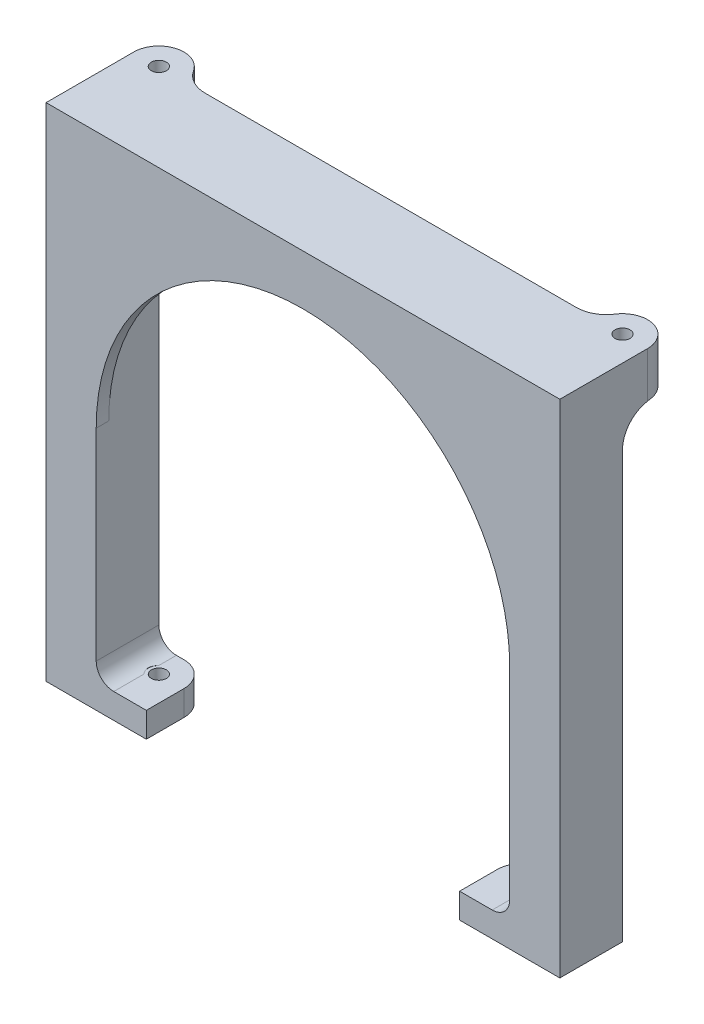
ISO-10303-21;
HEADER;
FILE_DESCRIPTION(('STEP AP214'),'2;1');
FILE_NAME('part.step','',(''),(''),'','','');
FILE_SCHEMA(('AUTOMOTIVE_DESIGN { 1 0 10303 214 1 1 1 1 }'));
ENDSEC;
DATA;
#1=APPLICATION_CONTEXT('core data for automotive mechanical design processes');
#2=APPLICATION_PROTOCOL_DEFINITION('international standard','automotive_design',2000,#1);
#3=PRODUCT_CONTEXT('',#1,'mechanical');
#4=PRODUCT('Part','Part','',(#3));
#5=PRODUCT_RELATED_PRODUCT_CATEGORY('part','',(#4));
#6=PRODUCT_DEFINITION_FORMATION('','',#4);
#7=PRODUCT_DEFINITION_CONTEXT('part definition',#1,'design');
#8=PRODUCT_DEFINITION('design','',#6,#7);
#9=PRODUCT_DEFINITION_SHAPE('','',#8);
#10=(LENGTH_UNIT() NAMED_UNIT(*) SI_UNIT(.MILLI.,.METRE.));
#11=(NAMED_UNIT(*) PLANE_ANGLE_UNIT() SI_UNIT($,.RADIAN.));
#12=(NAMED_UNIT(*) SI_UNIT($,.STERADIAN.) SOLID_ANGLE_UNIT());
#13=UNCERTAINTY_MEASURE_WITH_UNIT(LENGTH_MEASURE(1.E-05),#10,'distance_accuracy_value','');
#14=(GEOMETRIC_REPRESENTATION_CONTEXT(3) GLOBAL_UNCERTAINTY_ASSIGNED_CONTEXT((#13)) GLOBAL_UNIT_ASSIGNED_CONTEXT((#10,
#11,#12)) REPRESENTATION_CONTEXT('',''));
#15=CARTESIAN_POINT('',(0.,0.,0.));
#16=DIRECTION('',(0.,0.,1.));
#17=DIRECTION('',(1.,0.,0.));
#18=AXIS2_PLACEMENT_3D('',#15,#16,#17);
#19=CARTESIAN_POINT('',(-12.7,127.,-12.7));
#20=DIRECTION('',(0.,-1.,0.));
#21=DIRECTION('',(0.,0.,-1.));
#22=AXIS2_PLACEMENT_3D('',#19,#20,#21);
#23=CYLINDRICAL_SURFACE('',#22,1.905);
#24=CARTESIAN_POINT('',(-12.7,127.,-12.7));
#25=DIRECTION('',(0.,1.,0.));
#26=DIRECTION('',(0.,0.,1.));
#27=AXIS2_PLACEMENT_3D('',#24,#25,#26);
#28=CIRCLE('',#27,1.905);
#29=CARTESIAN_POINT('',(-12.7,127.,-10.795));
#30=VERTEX_POINT('',#29);
#31=EDGE_CURVE('E451',#30,#30,#28,.T.);
#32=ORIENTED_EDGE('',*,*,#31,.T.);
#33=EDGE_LOOP('',(#32));
#34=FACE_BOUND('',#33,.T.);
#35=CARTESIAN_POINT('',(-12.7,115.57,-12.7));
#36=DIRECTION('',(0.,-1.,0.));
#37=DIRECTION('',(0.,0.,-1.));
#38=AXIS2_PLACEMENT_3D('',#35,#36,#37);
#39=CIRCLE('',#38,1.905);
#40=CARTESIAN_POINT('',(-12.7,115.57,-14.605));
#41=VERTEX_POINT('',#40);
#42=EDGE_CURVE('E1056',#41,#41,#39,.T.);
#43=ORIENTED_EDGE('',*,*,#42,.T.);
#44=EDGE_LOOP('',(#43));
#45=FACE_BOUND('',#44,.T.);
#46=ADVANCED_FACE('F38',(#34,#45),#23,.F.);
#47=CARTESIAN_POINT('',(104.775,127.,-12.7));
#48=DIRECTION('',(0.,-1.,0.));
#49=DIRECTION('',(0.,0.,-1.));
#50=AXIS2_PLACEMENT_3D('',#47,#48,#49);
#51=CYLINDRICAL_SURFACE('',#50,1.90500000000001);
#52=CARTESIAN_POINT('',(104.775,127.,-12.7));
#53=DIRECTION('',(0.,1.,0.));
#54=DIRECTION('',(0.,0.,1.));
#55=AXIS2_PLACEMENT_3D('',#52,#53,#54);
#56=CIRCLE('',#55,1.90500000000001);
#57=CARTESIAN_POINT('',(104.775,127.,-10.795));
#58=VERTEX_POINT('',#57);
#59=EDGE_CURVE('E454',#58,#58,#56,.T.);
#60=ORIENTED_EDGE('',*,*,#59,.T.);
#61=EDGE_LOOP('',(#60));
#62=FACE_BOUND('',#61,.T.);
#63=CARTESIAN_POINT('',(104.775,115.57,-12.7));
#64=DIRECTION('',(0.,-1.,0.));
#65=DIRECTION('',(0.,0.,-1.));
#66=AXIS2_PLACEMENT_3D('',#63,#64,#65);
#67=CIRCLE('',#66,1.90500000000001);
#68=CARTESIAN_POINT('',(104.775,115.57,-14.605));
#69=VERTEX_POINT('',#68);
#70=EDGE_CURVE('E1066',#69,#69,#67,.T.);
#71=ORIENTED_EDGE('',*,*,#70,.T.);
#72=EDGE_LOOP('',(#71));
#73=FACE_BOUND('',#72,.T.);
#74=ADVANCED_FACE('F294',(#62,#73),#51,.F.);
#75=CARTESIAN_POINT('',(104.775,107.95,-13.97));
#76=DIRECTION('',(-1.,0.,0.));
#77=DIRECTION('',(0.,0.,1.));
#78=AXIS2_PLACEMENT_3D('',#75,#76,#77);
#79=CYLINDRICAL_SURFACE('',#78,7.62);
#80=CARTESIAN_POINT('',(-12.7,114.046,-9.398));
#81=CARTESIAN_POINT('',(-12.7820758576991,114.046000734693,-9.3980005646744));
#82=CARTESIAN_POINT('',(-12.8641612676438,114.048302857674,-9.40106553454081));
#83=CARTESIAN_POINT('',(-13.0276579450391,114.057429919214,-9.41327353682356));
#84=CARTESIAN_POINT('',(-13.1090688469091,114.0642571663,-9.42241967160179));
#85=CARTESIAN_POINT('',(-13.270660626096,114.082210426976,-9.44665802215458));
#86=CARTESIAN_POINT('',(-13.3508392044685,114.093343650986,-9.46176021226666));
#87=CARTESIAN_POINT('',(-13.5092663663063,114.119536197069,-9.49767244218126));
#88=CARTESIAN_POINT('',(-13.5875140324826,114.134597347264,-9.51848513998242));
#89=CARTESIAN_POINT('',(-13.8174342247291,114.184750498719,-9.58872232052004));
#90=CARTESIAN_POINT('',(-13.965627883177,114.224973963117,-9.64615411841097));
#91=CARTESIAN_POINT('',(-14.2497269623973,114.315135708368,-9.78002021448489));
#92=CARTESIAN_POINT('',(-14.3856317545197,114.365074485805,-9.85645548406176));
#93=CARTESIAN_POINT('',(-14.6582264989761,114.47676849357,-10.0357857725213));
#94=CARTESIAN_POINT('',(-14.7933147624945,114.539220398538,-10.1406806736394));
#95=CARTESIAN_POINT('',(-15.0451440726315,114.66684910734,-10.3692376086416));
#96=CARTESIAN_POINT('',(-15.1618721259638,114.732027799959,-10.492912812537));
#97=CARTESIAN_POINT('',(-15.3914332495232,114.870860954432,-10.7770851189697));
#98=CARTESIAN_POINT('',(-15.5010213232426,114.944310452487,-10.9403224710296));
#99=CARTESIAN_POINT('',(-15.6905089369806,115.084161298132,-11.2861947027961));
#100=CARTESIAN_POINT('',(-15.7704083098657,115.150562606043,-11.468829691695));
#101=CARTESIAN_POINT('',(-15.8644562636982,115.240654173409,-11.7518064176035));
#102=CARTESIAN_POINT('',(-15.8913590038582,115.268860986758,-11.8466347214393));
#103=CARTESIAN_POINT('',(-15.9367075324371,115.321990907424,-12.0391735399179));
#104=CARTESIAN_POINT('',(-15.955157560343,115.346915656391,-12.136882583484));
#105=CARTESIAN_POINT('',(-15.9832081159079,115.393074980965,-12.3343600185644));
#106=CARTESIAN_POINT('',(-15.9928136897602,115.414311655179,-12.4341272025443));
#107=CARTESIAN_POINT('',(-16.0028864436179,115.452819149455,-12.6348807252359));
#108=CARTESIAN_POINT('',(-16.0033548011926,115.470090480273,-12.7358669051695));
#109=CARTESIAN_POINT('',(-15.9954331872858,115.498785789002,-12.9267006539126));
#110=CARTESIAN_POINT('',(-15.9880327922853,115.51064876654,-13.0165246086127));
#111=CARTESIAN_POINT('',(-15.9658337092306,115.531090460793,-13.1956637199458));
#112=CARTESIAN_POINT('',(-15.951032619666,115.539668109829,-13.284978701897));
#113=CARTESIAN_POINT('',(-15.9140820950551,115.553585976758,-13.4622806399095));
#114=CARTESIAN_POINT('',(-15.8919370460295,115.558928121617,-13.5502683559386));
#115=CARTESIAN_POINT('',(-15.8404383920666,115.566535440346,-13.7242548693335));
#116=CARTESIAN_POINT('',(-15.8110821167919,115.568799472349,-13.8102529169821));
#117=CARTESIAN_POINT('',(-15.7160359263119,115.571201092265,-14.0550506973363));
#118=CARTESIAN_POINT('',(-15.6412713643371,115.567649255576,-14.2104785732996));
#119=CARTESIAN_POINT('',(-15.4687467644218,115.552484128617,-14.5074287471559));
#120=CARTESIAN_POINT('',(-15.3709835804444,115.540869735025,-14.6489491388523));
#121=CARTESIAN_POINT('',(-15.1511478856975,115.511869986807,-14.9195783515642));
#122=CARTESIAN_POINT('',(-15.0283310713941,115.494293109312,-15.0480623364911));
#123=CARTESIAN_POINT('',(-14.7638963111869,115.456873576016,-15.2835859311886));
#124=CARTESIAN_POINT('',(-14.6222724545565,115.437030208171,-15.3906187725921));
#125=CARTESIAN_POINT('',(-14.3162407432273,115.397503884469,-15.5853846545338));
#126=CARTESIAN_POINT('',(-14.151055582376,115.377876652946,-15.6719119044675));
#127=CARTESIAN_POINT('',(-13.8080629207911,115.343368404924,-15.8160868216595));
#128=CARTESIAN_POINT('',(-13.6302570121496,115.328486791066,-15.8737381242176));
#129=CARTESIAN_POINT('',(-13.2683842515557,115.306240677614,-15.9579718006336));
#130=CARTESIAN_POINT('',(-13.0843755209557,115.298819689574,-15.9847878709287));
#131=CARTESIAN_POINT('',(-12.7143419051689,115.292649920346,-16.0071648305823));
#132=CARTESIAN_POINT('',(-12.5283174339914,115.293899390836,-16.0027320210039));
#133=CARTESIAN_POINT('',(-12.1657065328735,115.30465987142,-15.9634271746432));
#134=CARTESIAN_POINT('',(-11.9890070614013,115.313910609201,-15.9295139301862));
#135=CARTESIAN_POINT('',(-11.64384940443,115.338747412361,-15.8336629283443));
#136=CARTESIAN_POINT('',(-11.4753924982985,115.354334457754,-15.7717208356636));
#137=CARTESIAN_POINT('',(-11.1485383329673,115.389520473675,-15.620462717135));
#138=CARTESIAN_POINT('',(-10.9903358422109,115.409177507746,-15.5307399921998));
#139=CARTESIAN_POINT('',(-10.6907788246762,115.448985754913,-15.3266135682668));
#140=CARTESIAN_POINT('',(-10.5494281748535,115.469137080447,-15.2122042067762));
#141=CARTESIAN_POINT('',(-10.2833123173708,115.506826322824,-14.9578046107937));
#142=CARTESIAN_POINT('',(-10.1591543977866,115.524270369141,-14.817163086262));
#143=CARTESIAN_POINT('',(-9.93615600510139,115.551879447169,-14.5164210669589));
#144=CARTESIAN_POINT('',(-9.83730913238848,115.562046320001,-14.3563255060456));
#145=CARTESIAN_POINT('',(-9.67049304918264,115.571531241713,-14.0260978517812));
#146=CARTESIAN_POINT('',(-9.60173370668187,115.571146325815,-13.8563745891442));
#147=CARTESIAN_POINT('',(-9.49329849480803,115.55799265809,-13.5083638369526));
#148=CARTESIAN_POINT('',(-9.45361068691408,115.545228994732,-13.330079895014));
#149=CARTESIAN_POINT('',(-9.4054281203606,115.507391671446,-12.9802659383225));
#150=CARTESIAN_POINT('',(-9.39541391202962,115.482995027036,-12.8088688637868));
#151=CARTESIAN_POINT('',(-9.40172206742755,115.42262959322,-12.4686455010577));
#152=CARTESIAN_POINT('',(-9.41804676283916,115.386659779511,-12.2998194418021));
#153=CARTESIAN_POINT('',(-9.47592088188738,115.304029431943,-11.9668825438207));
#154=CARTESIAN_POINT('',(-9.51780157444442,115.257233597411,-11.8028637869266));
#155=CARTESIAN_POINT('',(-9.62493760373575,115.15547769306,-11.4853826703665));
#156=CARTESIAN_POINT('',(-9.69019914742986,115.10051545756,-11.3319231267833));
#157=CARTESIAN_POINT('',(-9.8490387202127,114.979729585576,-11.0243086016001));
#158=CARTESIAN_POINT('',(-9.9446999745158,114.91337068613,-10.8714409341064));
#159=CARTESIAN_POINT('',(-10.1589298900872,114.778121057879,-10.5837803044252));
#160=CARTESIAN_POINT('',(-10.2775225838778,114.709227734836,-10.4490065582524));
#161=CARTESIAN_POINT('',(-10.5481310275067,114.566886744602,-10.1877512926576));
#162=CARTESIAN_POINT('',(-10.7022739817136,114.493646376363,-10.0633455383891));
#163=CARTESIAN_POINT('',(-11.0332717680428,114.356706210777,-9.84260393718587));
#164=CARTESIAN_POINT('',(-11.2101048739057,114.292997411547,-9.7462415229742));
#165=CARTESIAN_POINT('',(-11.5391466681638,114.196268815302,-9.60490142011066));
#166=CARTESIAN_POINT('',(-11.6873328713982,114.159554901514,-9.55316545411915));
#167=CARTESIAN_POINT('',(-11.915695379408,114.115088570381,-9.4915283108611));
#168=CARTESIAN_POINT('',(-11.992758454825,114.102040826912,-9.47365260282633));
#169=CARTESIAN_POINT('',(-12.1484968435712,114.07982952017,-9.44341767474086));
#170=CARTESIAN_POINT('',(-12.2271713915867,114.070664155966,-9.43105589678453));
#171=CARTESIAN_POINT('',(-12.3714862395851,114.057771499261,-9.41372740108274));
#172=CARTESIAN_POINT('',(-12.4369574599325,114.053367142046,-9.407836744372));
#173=CARTESIAN_POINT('',(-12.5682836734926,114.047480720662,-9.39997231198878));
#174=CARTESIAN_POINT('',(-12.6341387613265,114.045999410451,-9.3979995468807));
#175=CARTESIAN_POINT('',(-12.7,114.046,-9.398));
#176=B_SPLINE_CURVE_WITH_KNOTS('',3,(#80,#81,#82,#83,#84,#85,#86,#87,#88,#89,#90,#91,#92,#93,
#94,#95,#96,#97,#98,#99,#100,#101,#102,#103,#104,#105,#106,#107,#108,#109,#110,#111,#112,#113,
#114,#115,#116,#117,#118,#119,#120,#121,#122,#123,#124,#125,#126,#127,#128,#129,#130,#131,#132,
#133,#134,#135,#136,#137,#138,#139,#140,#141,#142,#143,#144,#145,#146,#147,#148,#149,#150,#151,
#152,#153,#154,#155,#156,#157,#158,#159,#160,#161,#162,#163,#164,#165,#166,#167,#168,#169,#170,
#171,#172,#173,#174,#175),.UNSPECIFIED.,.T.,.F.,(4,2,2,2,2,2,2,2,2,2,2,2,2,2,2,2,2,2,2,2,2,2,2,
2,2,2,2,2,2,2,2,2,2,2,2,2,2,2,2,2,2,2,2,2,2,2,2,4),(0.,0.246155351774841,0.492436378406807,
0.739131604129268,0.985941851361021,1.47550659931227,1.96509637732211,2.50926930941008,
3.05382562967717,3.68054507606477,4.30726805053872,4.61448510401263,4.92154790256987,
5.2284353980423,5.53528334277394,5.80764797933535,6.08010105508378,6.3523917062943,
6.62478333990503,7.13976054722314,7.65480824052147,8.1882746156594,8.72190904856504,
9.28174734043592,9.84151513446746,10.3970119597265,10.9523967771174,11.4903672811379,
12.02842102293,12.5747572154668,13.1212188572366,13.6836915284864,14.2460218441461,
14.7925391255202,15.3388318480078,15.85662191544,16.3744578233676,16.8991531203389,
17.423987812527,17.9980957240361,18.572808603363,19.2033242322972,19.8332405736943,
20.3146578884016,20.5549371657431,20.79510486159,20.9925796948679,21.1901054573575),.UNSPECIFIED.);
#177=CARTESIAN_POINT('',(-9.652,115.57,-13.97));
#178=VERTEX_POINT('',#177);
#179=CARTESIAN_POINT('',(-15.748,115.57,-13.97));
#180=VERTEX_POINT('',#179);
#181=EDGE_CURVE('E11',#178,#180,#176,.T.);
#182=ORIENTED_EDGE('',*,*,#181,.F.);
#183=DIRECTION('',(-1.,0.,0.));
#184=VECTOR('',#183,1.);
#185=CARTESIAN_POINT('',(104.775,115.57,-13.97));
#186=LINE('',#185,#184);
#187=CARTESIAN_POINT('',(-5.20329202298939,115.57,-13.97));
#188=VERTEX_POINT('',#187);
#189=EDGE_CURVE('E67',#188,#178,#186,.T.);
#190=ORIENTED_EDGE('',*,*,#189,.F.);
#191=CARTESIAN_POINT('',(-5.20329202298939,115.57,-13.97));
#192=CARTESIAN_POINT('',(-5.02304626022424,115.569964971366,-13.8504090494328));
#193=CARTESIAN_POINT('',(-4.83771518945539,115.56718302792,-13.7385550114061));
#194=CARTESIAN_POINT('',(-4.45828992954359,115.558063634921,-13.5310241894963));
#195=CARTESIAN_POINT('',(-4.26419597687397,115.551726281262,-13.4353469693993));
#196=CARTESIAN_POINT('',(-3.87339776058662,115.53760599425,-13.2629642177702));
#197=CARTESIAN_POINT('',(-3.67686845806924,115.529861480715,-13.1858578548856));
#198=CARTESIAN_POINT('',(-3.27811840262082,115.514359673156,-13.0482213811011));
#199=CARTESIAN_POINT('',(-3.0758988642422,115.506602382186,-12.9876877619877));
#200=CARTESIAN_POINT('',(-2.71951035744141,115.49416635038,-12.8969354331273));
#201=CARTESIAN_POINT('',(-2.56630496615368,115.489208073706,-12.8629233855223));
#202=CARTESIAN_POINT('',(-2.25807365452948,115.480384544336,-12.8044177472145));
#203=CARTESIAN_POINT('',(-2.103048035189,115.476519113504,-12.7799226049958));
#204=CARTESIAN_POINT('',(-1.78891082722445,115.470133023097,-12.7401888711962));
#205=CARTESIAN_POINT('',(-1.62977630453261,115.467638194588,-12.7251273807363));
#206=CARTESIAN_POINT('',(-1.31082176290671,115.464270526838,-12.7050279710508));
#207=CARTESIAN_POINT('',(-1.15100159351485,115.463398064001,-12.6999923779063));
#208=CARTESIAN_POINT('',(-0.991178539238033,115.463421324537,-12.7));
#209=B_SPLINE_CURVE_WITH_KNOTS('',3,(#191,#192,#193,#194,#195,#196,#197,#198,#199,#200,#201,
#202,#203,#204,#205,#206,#207,#208),.UNSPECIFIED.,.F.,.F.,(4,2,2,2,2,2,2,2,4),(0.,
0.648668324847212,1.29731915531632,1.93037434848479,2.56329542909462,3.03405349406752,
3.50473478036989,3.98400649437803,4.46338938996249),.UNSPECIFIED.);
#210=CARTESIAN_POINT('',(-0.991178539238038,115.463421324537,-12.7));
#211=VERTEX_POINT('',#210);
#212=EDGE_CURVE('E315',#188,#211,#209,.T.);
#213=ORIENTED_EDGE('',*,*,#212,.T.);
#214=DIRECTION('',(-1.,0.,0.));
#215=VECTOR('',#214,1.);
#216=CARTESIAN_POINT('',(98.425,115.463421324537,-12.7));
#217=LINE('',#216,#215);
#218=CARTESIAN_POINT('',(93.0661785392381,115.463421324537,-12.7));
#219=VERTEX_POINT('',#218);
#220=EDGE_CURVE('E273',#219,#211,#217,.T.);
#221=ORIENTED_EDGE('',*,*,#220,.F.);
#222=CARTESIAN_POINT('',(93.0661785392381,115.463421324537,-12.7));
#223=CARTESIAN_POINT('',(93.1743175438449,115.463417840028,-12.6999998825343));
#224=CARTESIAN_POINT('',(93.2824429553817,115.463810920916,-12.7023023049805));
#225=CARTESIAN_POINT('',(93.4984902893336,115.465359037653,-12.7115048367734));
#226=CARTESIAN_POINT('',(93.6064122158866,115.466514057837,-12.7184048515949));
#227=CARTESIAN_POINT('',(93.9295625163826,115.471074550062,-12.7459858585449));
#228=CARTESIAN_POINT('',(94.144228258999,115.475575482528,-12.7735478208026));
#229=CARTESIAN_POINT('',(94.5652499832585,115.486721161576,-12.8459304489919));
#230=CARTESIAN_POINT('',(94.771681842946,115.49331197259,-12.8903218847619));
#231=CARTESIAN_POINT('',(95.1800428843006,115.507686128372,-12.9960334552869));
#232=CARTESIAN_POINT('',(95.3819729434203,115.515469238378,-13.0573502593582));
#233=CARTESIAN_POINT('',(95.8771459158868,115.534751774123,-13.2304940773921));
#234=CARTESIAN_POINT('',(96.1669715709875,115.546215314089,-13.3523775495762));
#235=CARTESIAN_POINT('',(96.5912622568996,115.559425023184,-13.5625021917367));
#236=CARTESIAN_POINT('',(96.7321808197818,115.563179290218,-13.637906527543));
#237=CARTESIAN_POINT('',(97.0090737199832,115.568463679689,-13.7974624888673));
#238=CARTESIAN_POINT('',(97.1450465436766,115.569993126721,-13.8816167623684));
#239=CARTESIAN_POINT('',(97.2782920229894,115.57,-13.97));
#240=B_SPLINE_CURVE_WITH_KNOTS('',3,(#222,#223,#224,#225,#226,#227,#228,#229,#230,#231,#232,
#233,#234,#235,#236,#237,#238,#239),.UNSPECIFIED.,.F.,.F.,(4,2,2,2,2,2,2,2,4),(0.,
0.324364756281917,0.648722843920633,1.29728100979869,1.93030360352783,2.56320171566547,
3.50429158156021,3.98361909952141,4.46309210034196),.UNSPECIFIED.);
#241=CARTESIAN_POINT('',(97.2782920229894,115.57,-13.97));
#242=VERTEX_POINT('',#241);
#243=EDGE_CURVE('E323',#219,#242,#240,.T.);
#244=ORIENTED_EDGE('',*,*,#243,.T.);
#245=DIRECTION('',(-1.,0.,0.));
#246=VECTOR('',#245,1.);
#247=CARTESIAN_POINT('',(104.775,115.57,-13.97));
#248=LINE('',#247,#246);
#249=CARTESIAN_POINT('',(101.727,115.57,-13.97));
#250=VERTEX_POINT('',#249);
#251=EDGE_CURVE('E59',#250,#242,#248,.T.);
#252=ORIENTED_EDGE('',*,*,#251,.F.);
#253=CARTESIAN_POINT('',(104.775,114.046,-9.398));
#254=CARTESIAN_POINT('',(104.692924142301,114.046000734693,-9.3980005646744));
#255=CARTESIAN_POINT('',(104.610838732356,114.048302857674,-9.40106553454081));
#256=CARTESIAN_POINT('',(104.447342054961,114.057429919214,-9.41327353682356));
#257=CARTESIAN_POINT('',(104.365931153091,114.0642571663,-9.42241967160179));
#258=CARTESIAN_POINT('',(104.204339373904,114.082210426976,-9.44665802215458));
#259=CARTESIAN_POINT('',(104.124160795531,114.093343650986,-9.46176021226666));
#260=CARTESIAN_POINT('',(103.965733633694,114.119536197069,-9.49767244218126));
#261=CARTESIAN_POINT('',(103.887485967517,114.134597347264,-9.51848513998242));
#262=CARTESIAN_POINT('',(103.657565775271,114.184750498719,-9.58872232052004));
#263=CARTESIAN_POINT('',(103.509372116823,114.224973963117,-9.64615411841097));
#264=CARTESIAN_POINT('',(103.225273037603,114.315135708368,-9.78002021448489));
#265=CARTESIAN_POINT('',(103.08936824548,114.365074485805,-9.85645548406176));
#266=CARTESIAN_POINT('',(102.816773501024,114.47676849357,-10.0357857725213));
#267=CARTESIAN_POINT('',(102.681685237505,114.539220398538,-10.1406806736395));
#268=CARTESIAN_POINT('',(102.429855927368,114.66684910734,-10.3692376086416));
#269=CARTESIAN_POINT('',(102.313127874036,114.732027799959,-10.492912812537));
#270=CARTESIAN_POINT('',(102.083566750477,114.870860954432,-10.7770851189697));
#271=CARTESIAN_POINT('',(101.973978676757,114.944310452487,-10.9403224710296));
#272=CARTESIAN_POINT('',(101.784491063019,115.084161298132,-11.2861947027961));
#273=CARTESIAN_POINT('',(101.704591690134,115.150562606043,-11.468829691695));
#274=CARTESIAN_POINT('',(101.610543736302,115.240654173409,-11.7518064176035));
#275=CARTESIAN_POINT('',(101.583640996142,115.268860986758,-11.8466347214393));
#276=CARTESIAN_POINT('',(101.538292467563,115.321990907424,-12.0391735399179));
#277=CARTESIAN_POINT('',(101.519842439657,115.346915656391,-12.136882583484));
#278=CARTESIAN_POINT('',(101.491791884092,115.393074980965,-12.3343600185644));
#279=CARTESIAN_POINT('',(101.48218631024,115.414311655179,-12.4341272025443));
#280=CARTESIAN_POINT('',(101.472113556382,115.452819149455,-12.6348807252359));
#281=CARTESIAN_POINT('',(101.471645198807,115.470090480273,-12.7358669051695));
#282=CARTESIAN_POINT('',(101.479566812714,115.498785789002,-12.9267006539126));
#283=CARTESIAN_POINT('',(101.486967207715,115.51064876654,-13.0165246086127));
#284=CARTESIAN_POINT('',(101.509166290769,115.531090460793,-13.1956637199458));
#285=CARTESIAN_POINT('',(101.523967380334,115.539668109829,-13.284978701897));
#286=CARTESIAN_POINT('',(101.560917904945,115.553585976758,-13.4622806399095));
#287=CARTESIAN_POINT('',(101.58306295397,115.558928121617,-13.5502683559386));
#288=CARTESIAN_POINT('',(101.634561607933,115.566535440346,-13.7242548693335));
#289=CARTESIAN_POINT('',(101.663917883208,115.568799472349,-13.8102529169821));
#290=CARTESIAN_POINT('',(101.758964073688,115.571201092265,-14.0550506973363));
#291=CARTESIAN_POINT('',(101.833728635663,115.567649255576,-14.2104785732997));
#292=CARTESIAN_POINT('',(102.006253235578,115.552484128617,-14.5074287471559));
#293=CARTESIAN_POINT('',(102.104016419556,115.540869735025,-14.6489491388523));
#294=CARTESIAN_POINT('',(102.323852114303,115.511869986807,-14.9195783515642));
#295=CARTESIAN_POINT('',(102.446668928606,115.494293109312,-15.0480623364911));
#296=CARTESIAN_POINT('',(102.711103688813,115.456873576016,-15.2835859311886));
#297=CARTESIAN_POINT('',(102.852727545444,115.437030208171,-15.3906187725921));
#298=CARTESIAN_POINT('',(103.158759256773,115.397503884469,-15.5853846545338));
#299=CARTESIAN_POINT('',(103.323944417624,115.377876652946,-15.6719119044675));
#300=CARTESIAN_POINT('',(103.666937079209,115.343368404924,-15.8160868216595));
#301=CARTESIAN_POINT('',(103.84474298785,115.328486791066,-15.8737381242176));
#302=CARTESIAN_POINT('',(104.206615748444,115.306240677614,-15.9579718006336));
#303=CARTESIAN_POINT('',(104.390624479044,115.298819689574,-15.9847878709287));
#304=CARTESIAN_POINT('',(104.760658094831,115.292649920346,-16.0071648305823));
#305=CARTESIAN_POINT('',(104.946682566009,115.293899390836,-16.0027320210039));
#306=CARTESIAN_POINT('',(105.309293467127,115.30465987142,-15.9634271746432));
#307=CARTESIAN_POINT('',(105.485992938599,115.313910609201,-15.9295139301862));
#308=CARTESIAN_POINT('',(105.83115059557,115.338747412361,-15.8336629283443));
#309=CARTESIAN_POINT('',(105.999607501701,115.354334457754,-15.7717208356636));
#310=CARTESIAN_POINT('',(106.326461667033,115.389520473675,-15.620462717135));
#311=CARTESIAN_POINT('',(106.484664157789,115.409177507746,-15.5307399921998));
#312=CARTESIAN_POINT('',(106.784221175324,115.448985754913,-15.3266135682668));
#313=CARTESIAN_POINT('',(106.925571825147,115.469137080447,-15.2122042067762));
#314=CARTESIAN_POINT('',(107.191687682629,115.506826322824,-14.9578046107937));
#315=CARTESIAN_POINT('',(107.315845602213,115.524270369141,-14.817163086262));
#316=CARTESIAN_POINT('',(107.538843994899,115.551879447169,-14.5164210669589));
#317=CARTESIAN_POINT('',(107.637690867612,115.562046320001,-14.3563255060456));
#318=CARTESIAN_POINT('',(107.804506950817,115.571531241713,-14.0260978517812));
#319=CARTESIAN_POINT('',(107.873266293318,115.571146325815,-13.8563745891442));
#320=CARTESIAN_POINT('',(107.981701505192,115.55799265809,-13.5083638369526));
#321=CARTESIAN_POINT('',(108.021389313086,115.545228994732,-13.330079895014));
#322=CARTESIAN_POINT('',(108.069571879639,115.507391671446,-12.9802659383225));
#323=CARTESIAN_POINT('',(108.07958608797,115.482995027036,-12.8088688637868));
#324=CARTESIAN_POINT('',(108.073277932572,115.42262959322,-12.4686455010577));
#325=CARTESIAN_POINT('',(108.056953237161,115.386659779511,-12.2998194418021));
#326=CARTESIAN_POINT('',(107.999079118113,115.304029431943,-11.9668825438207));
#327=CARTESIAN_POINT('',(107.957198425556,115.257233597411,-11.8028637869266));
#328=CARTESIAN_POINT('',(107.850062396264,115.15547769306,-11.4853826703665));
#329=CARTESIAN_POINT('',(107.78480085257,115.10051545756,-11.3319231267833));
#330=CARTESIAN_POINT('',(107.625961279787,114.979729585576,-11.0243086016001));
#331=CARTESIAN_POINT('',(107.530300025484,114.91337068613,-10.8714409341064));
#332=CARTESIAN_POINT('',(107.316070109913,114.778121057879,-10.5837803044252));
#333=CARTESIAN_POINT('',(107.197477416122,114.709227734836,-10.4490065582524));
#334=CARTESIAN_POINT('',(106.926868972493,114.566886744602,-10.1877512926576));
#335=CARTESIAN_POINT('',(106.772726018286,114.493646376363,-10.0633455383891));
#336=CARTESIAN_POINT('',(106.441728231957,114.356706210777,-9.84260393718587));
#337=CARTESIAN_POINT('',(106.264895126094,114.292997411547,-9.7462415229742));
#338=CARTESIAN_POINT('',(105.935853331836,114.196268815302,-9.60490142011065));
#339=CARTESIAN_POINT('',(105.787667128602,114.159554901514,-9.55316545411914));
#340=CARTESIAN_POINT('',(105.559304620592,114.115088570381,-9.4915283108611));
#341=CARTESIAN_POINT('',(105.482241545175,114.102040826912,-9.47365260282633));
#342=CARTESIAN_POINT('',(105.326503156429,114.07982952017,-9.44341767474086));
#343=CARTESIAN_POINT('',(105.247828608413,114.070664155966,-9.43105589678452));
#344=CARTESIAN_POINT('',(105.103513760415,114.057771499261,-9.41372740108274));
#345=CARTESIAN_POINT('',(105.038042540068,114.053367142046,-9.407836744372));
#346=CARTESIAN_POINT('',(104.906716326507,114.047480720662,-9.39997231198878));
#347=CARTESIAN_POINT('',(104.840861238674,114.045999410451,-9.3979995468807));
#348=CARTESIAN_POINT('',(104.775,114.046,-9.398));
#349=B_SPLINE_CURVE_WITH_KNOTS('',3,(#253,#254,#255,#256,#257,#258,#259,#260,#261,#262,#263,
#264,#265,#266,#267,#268,#269,#270,#271,#272,#273,#274,#275,#276,#277,#278,#279,#280,#281,#282,
#283,#284,#285,#286,#287,#288,#289,#290,#291,#292,#293,#294,#295,#296,#297,#298,#299,#300,#301,
#302,#303,#304,#305,#306,#307,#308,#309,#310,#311,#312,#313,#314,#315,#316,#317,#318,#319,#320,
#321,#322,#323,#324,#325,#326,#327,#328,#329,#330,#331,#332,#333,#334,#335,#336,#337,#338,#339,
#340,#341,#342,#343,#344,#345,#346,#347,#348),.UNSPECIFIED.,.T.,.F.,(4,2,2,2,2,2,2,2,2,2,2,2,2,
2,2,2,2,2,2,2,2,2,2,2,2,2,2,2,2,2,2,2,2,2,2,2,2,2,2,2,2,2,2,2,2,2,2,4),(0.,0.246155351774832,
0.492436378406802,0.73913160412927,0.985941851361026,1.47550659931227,1.96509637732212,
2.5092693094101,3.05382562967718,3.68054507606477,4.30726805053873,4.61448510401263,
4.92154790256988,5.2284353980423,5.53528334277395,5.80764797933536,6.08010105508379,
6.35239170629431,6.62478333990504,7.13976054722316,7.65480824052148,8.1882746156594,
8.72190904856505,9.28174734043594,9.84151513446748,10.3970119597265,10.9523967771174,
11.4903672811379,12.02842102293,12.5747572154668,13.1212188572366,13.6836915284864,
14.2460218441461,14.7925391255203,15.3388318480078,15.85662191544,16.3744578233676,
16.8991531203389,17.423987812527,17.9980957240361,18.572808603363,19.2033242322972,
19.8332405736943,20.3146578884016,20.5549371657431,20.79510486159,20.9925796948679,
21.1901054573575),.UNSPECIFIED.);
#350=CARTESIAN_POINT('',(107.823,115.57,-13.97));
#351=VERTEX_POINT('',#350);
#352=EDGE_CURVE('E52',#351,#250,#349,.T.);
#353=ORIENTED_EDGE('',*,*,#352,.F.);
#354=DIRECTION('',(-1.,0.,0.));
#355=VECTOR('',#354,1.);
#356=CARTESIAN_POINT('',(104.775,115.57,-13.97));
#357=LINE('',#356,#355);
#358=CARTESIAN_POINT('',(110.996703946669,115.57,-13.97));
#359=VERTEX_POINT('',#358);
#360=EDGE_CURVE('E258',#359,#351,#357,.T.);
#361=ORIENTED_EDGE('',*,*,#360,.F.);
#362=CARTESIAN_POINT('',(111.125,115.463421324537,-12.7));
#363=CARTESIAN_POINT('',(111.125008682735,115.481309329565,-12.8057725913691));
#364=CARTESIAN_POINT('',(111.12235716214,115.496946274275,-12.9119281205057));
#365=CARTESIAN_POINT('',(111.111707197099,115.523650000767,-13.1240842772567));
#366=CARTESIAN_POINT('',(111.103731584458,115.534735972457,-13.2300836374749));
#367=CARTESIAN_POINT('',(111.082407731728,115.552422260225,-13.4419160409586));
#368=CARTESIAN_POINT('',(111.06905949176,115.559022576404,-13.5477490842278));
#369=CARTESIAN_POINT('',(111.036950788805,115.567825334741,-13.7592397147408));
#370=CARTESIAN_POINT('',(111.018167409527,115.570008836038,-13.8648946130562));
#371=CARTESIAN_POINT('',(110.996703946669,115.57,-13.97));
#372=B_SPLINE_CURVE_WITH_KNOTS('',3,(#362,#363,#364,#365,#366,#367,#368,#369,#370,#371),
.UNSPECIFIED.,.F.,.F.,(4,2,2,2,4),(0.,0.321769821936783,0.642168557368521,0.962567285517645,
1.28433710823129),.UNSPECIFIED.);
#373=CARTESIAN_POINT('',(111.125,115.463421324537,-12.7));
#374=VERTEX_POINT('',#373);
#375=EDGE_CURVE('E306',#374,#359,#372,.T.);
#376=ORIENTED_EDGE('',*,*,#375,.F.);
#377=CARTESIAN_POINT('',(111.125,107.95,-13.97));
#378=DIRECTION('',(-1.,0.,0.));
#379=DIRECTION('',(0.,0.,1.));
#380=AXIS2_PLACEMENT_3D('',#377,#378,#379);
#381=CIRCLE('',#380,7.62);
#382=CARTESIAN_POINT('',(111.125,107.95,-6.35000000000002));
#383=VERTEX_POINT('',#382);
#384=EDGE_CURVE('E1085',#383,#374,#381,.T.);
#385=ORIENTED_EDGE('',*,*,#384,.F.);
#386=DIRECTION('',(-1.,0.,0.));
#387=VECTOR('',#386,1.);
#388=CARTESIAN_POINT('',(0.,107.95,-6.35));
#389=LINE('',#388,#387);
#390=CARTESIAN_POINT('',(98.425,107.95,-6.35000000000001));
#391=VERTEX_POINT('',#390);
#392=EDGE_CURVE('E265',#391,#383,#389,.F.);
#393=ORIENTED_EDGE('',*,*,#392,.F.);
#394=CARTESIAN_POINT('',(98.425,107.95,-13.97));
#395=DIRECTION('',(1.,0.,0.));
#396=DIRECTION('',(0.,0.,-1.));
#397=AXIS2_PLACEMENT_3D('',#394,#395,#396);
#398=CIRCLE('',#397,7.62);
#399=CARTESIAN_POINT('',(98.425,114.3,-9.75788651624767));
#400=VERTEX_POINT('',#399);
#401=EDGE_CURVE('E1097',#400,#391,#398,.T.);
#402=ORIENTED_EDGE('',*,*,#401,.F.);
#403=DIRECTION('',(-1.,0.,0.));
#404=VECTOR('',#403,1.);
#405=CARTESIAN_POINT('',(-6.35,114.3,-9.75788651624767));
#406=LINE('',#405,#404);
#407=CARTESIAN_POINT('',(-6.35,114.3,-9.75788651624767));
#408=VERTEX_POINT('',#407);
#409=EDGE_CURVE('E676',#408,#400,#406,.F.);
#410=ORIENTED_EDGE('',*,*,#409,.F.);
#411=CARTESIAN_POINT('',(-6.34999999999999,107.95,-13.97));
#412=DIRECTION('',(-1.,0.,0.));
#413=DIRECTION('',(0.,0.,1.));
#414=AXIS2_PLACEMENT_3D('',#411,#412,#413);
#415=CIRCLE('',#414,7.62);
#416=CARTESIAN_POINT('',(-6.35,107.95,-6.35));
#417=VERTEX_POINT('',#416);
#418=EDGE_CURVE('E1100',#417,#408,#415,.T.);
#419=ORIENTED_EDGE('',*,*,#418,.F.);
#420=DIRECTION('',(-1.,0.,0.));
#421=VECTOR('',#420,1.);
#422=CARTESIAN_POINT('',(0.,107.95,-6.35));
#423=LINE('',#422,#421);
#424=CARTESIAN_POINT('',(-19.05,107.95,-6.35));
#425=VERTEX_POINT('',#424);
#426=EDGE_CURVE('E267',#425,#417,#423,.F.);
#427=ORIENTED_EDGE('',*,*,#426,.F.);
#428=CARTESIAN_POINT('',(-19.05,107.95,-13.97));
#429=DIRECTION('',(1.,0.,0.));
#430=DIRECTION('',(0.,0.,-1.));
#431=AXIS2_PLACEMENT_3D('',#428,#429,#430);
#432=CIRCLE('',#431,7.62);
#433=CARTESIAN_POINT('',(-19.05,115.463421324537,-12.7));
#434=VERTEX_POINT('',#433);
#435=EDGE_CURVE('E284',#434,#425,#432,.T.);
#436=ORIENTED_EDGE('',*,*,#435,.F.);
#437=CARTESIAN_POINT('',(-18.9217039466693,115.57,-13.97));
#438=CARTESIAN_POINT('',(-18.9431674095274,115.570008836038,-13.8648946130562));
#439=CARTESIAN_POINT('',(-18.9619507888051,115.567825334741,-13.7592397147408));
#440=CARTESIAN_POINT('',(-18.99405949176,115.559022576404,-13.5477490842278));
#441=CARTESIAN_POINT('',(-19.0074077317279,115.552422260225,-13.4419160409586));
#442=CARTESIAN_POINT('',(-19.0287315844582,115.534735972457,-13.2300836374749));
#443=CARTESIAN_POINT('',(-19.0367071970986,115.523650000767,-13.1240842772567));
#444=CARTESIAN_POINT('',(-19.0473571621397,115.496946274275,-12.9119281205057));
#445=CARTESIAN_POINT('',(-19.0500086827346,115.481309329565,-12.8057725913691));
#446=CARTESIAN_POINT('',(-19.05,115.463421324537,-12.7));
#447=B_SPLINE_CURVE_WITH_KNOTS('',3,(#437,#438,#439,#440,#441,#442,#443,#444,#445,#446),
.UNSPECIFIED.,.F.,.F.,(4,2,2,2,4),(0.,0.321769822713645,0.642168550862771,0.962567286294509,
1.28433710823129),.UNSPECIFIED.);
#448=CARTESIAN_POINT('',(-18.9217039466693,115.57,-13.97));
#449=VERTEX_POINT('',#448);
#450=EDGE_CURVE('E276',#449,#434,#447,.T.);
#451=ORIENTED_EDGE('',*,*,#450,.F.);
#452=DIRECTION('',(-1.,0.,0.));
#453=VECTOR('',#452,1.);
#454=CARTESIAN_POINT('',(104.775,115.57,-13.97));
#455=LINE('',#454,#453);
#456=EDGE_CURVE('E371',#180,#449,#455,.T.);
#457=ORIENTED_EDGE('',*,*,#456,.F.);
#458=EDGE_LOOP('',(#182,#190,#213,#221,#244,#252,#353,#361,#376,#385,#393,#402,#410,#419,#427,
#436,#451,#457));
#459=FACE_BOUND('',#458,.T.);
#460=ADVANCED_FACE('F256',(#459),#79,.F.);
#461=CARTESIAN_POINT('',(0.,6.35,-6.35));
#462=DIRECTION('',(0.,0.,1.));
#463=DIRECTION('',(1.,0.,0.));
#464=AXIS2_PLACEMENT_3D('',#461,#462,#463);
#465=PLANE('',#464);
#466=DIRECTION('',(0.,-1.,0.));
#467=VECTOR('',#466,1.);
#468=CARTESIAN_POINT('',(-19.05,6.35,-6.35));
#469=LINE('',#468,#467);
#470=CARTESIAN_POINT('',(-19.05,0.,-6.35));
#471=VERTEX_POINT('',#470);
#472=EDGE_CURVE('E510',#425,#471,#469,.T.);
#473=ORIENTED_EDGE('',*,*,#472,.F.);
#474=ORIENTED_EDGE('',*,*,#426,.T.);
#475=DIRECTION('',(0.,-1.,0.));
#476=VECTOR('',#475,1.);
#477=CARTESIAN_POINT('',(-6.35,120.65,-6.35));
#478=LINE('',#477,#476);
#479=CARTESIAN_POINT('',(-6.35,10.795,-6.35));
#480=VERTEX_POINT('',#479);
#481=EDGE_CURVE('E479',#417,#480,#478,.T.);
#482=ORIENTED_EDGE('',*,*,#481,.T.);
#483=CARTESIAN_POINT('',(-1.905,10.795,-6.35));
#484=DIRECTION('',(0.,0.,1.));
#485=DIRECTION('',(1.,0.,0.));
#486=AXIS2_PLACEMENT_3D('',#483,#484,#485);
#487=CIRCLE('',#486,4.445);
#488=CARTESIAN_POINT('',(-1.905,6.35,-6.35));
#489=VERTEX_POINT('',#488);
#490=EDGE_CURVE('E531',#480,#489,#487,.T.);
#491=ORIENTED_EDGE('',*,*,#490,.T.);
#492=DIRECTION('',(-1.,0.,0.));
#493=VECTOR('',#492,1.);
#494=CARTESIAN_POINT('',(0.,6.35,-6.35));
#495=LINE('',#494,#493);
#496=CARTESIAN_POINT('',(0.,6.35,-6.35));
#497=VERTEX_POINT('',#496);
#498=EDGE_CURVE('E493',#497,#489,#495,.T.);
#499=ORIENTED_EDGE('',*,*,#498,.F.);
#500=DIRECTION('',(0.,-1.,0.));
#501=VECTOR('',#500,1.);
#502=CARTESIAN_POINT('',(0.,6.35,-6.35));
#503=LINE('',#502,#501);
#504=CARTESIAN_POINT('',(0.,0.,-6.35));
#505=VERTEX_POINT('',#504);
#506=EDGE_CURVE('E512',#497,#505,#503,.T.);
#507=ORIENTED_EDGE('',*,*,#506,.T.);
#508=DIRECTION('',(-1.,0.,0.));
#509=VECTOR('',#508,1.);
#510=CARTESIAN_POINT('',(0.,0.,-6.35));
#511=LINE('',#510,#509);
#512=EDGE_CURVE('E502',#505,#471,#511,.T.);
#513=ORIENTED_EDGE('',*,*,#512,.T.);
#514=EDGE_LOOP('',(#473,#474,#482,#491,#499,#507,#513));
#515=FACE_BOUND('',#514,.T.);
#516=ADVANCED_FACE('F293',(#515),#465,.F.);
#517=CARTESIAN_POINT('',(104.775,115.57,-12.7));
#518=DIRECTION('',(0.,-1.,0.));
#519=DIRECTION('',(0.,0.,-1.));
#520=AXIS2_PLACEMENT_3D('',#517,#518,#519);
#521=PLANE('',#520);
#522=ORIENTED_EDGE('',*,*,#360,.T.);
#523=CARTESIAN_POINT('',(104.775,115.57,-12.7));
#524=DIRECTION('',(0.,-1.,0.));
#525=DIRECTION('',(0.,0.,-1.));
#526=AXIS2_PLACEMENT_3D('',#523,#524,#525);
#527=CIRCLE('',#526,3.302);
#528=EDGE_CURVE('E249',#351,#250,#527,.T.);
#529=ORIENTED_EDGE('',*,*,#528,.T.);
#530=ORIENTED_EDGE('',*,*,#251,.T.);
#531=CARTESIAN_POINT('',(93.0661785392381,115.57,-20.32));
#532=DIRECTION('',(0.,-1.,0.));
#533=DIRECTION('',(0.,0.,-1.));
#534=AXIS2_PLACEMENT_3D('',#531,#532,#533);
#535=CIRCLE('',#534,7.62);
#536=CARTESIAN_POINT('',(99.4528084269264,115.57,-16.1636363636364));
#537=VERTEX_POINT('',#536);
#538=EDGE_CURVE('E329',#242,#537,#535,.F.);
#539=ORIENTED_EDGE('',*,*,#538,.T.);
#540=CARTESIAN_POINT('',(104.775,115.57,-12.7));
#541=DIRECTION('',(0.,-1.,0.));
#542=DIRECTION('',(0.,0.,-1.));
#543=AXIS2_PLACEMENT_3D('',#540,#541,#542);
#544=CIRCLE('',#543,6.34999999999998);
#545=EDGE_CURVE('E263',#537,#359,#544,.T.);
#546=ORIENTED_EDGE('',*,*,#545,.T.);
#547=EDGE_LOOP('',(#522,#529,#530,#539,#546));
#548=FACE_BOUND('',#547,.T.);
#549=ORIENTED_EDGE('',*,*,#70,.F.);
#550=EDGE_LOOP('',(#549));
#551=FACE_BOUND('',#550,.T.);
#552=ADVANCED_FACE('F260',(#548,#551),#521,.T.);
#553=CARTESIAN_POINT('',(-1.905,10.795,6.35));
#554=DIRECTION('',(0.,0.,-1.));
#555=DIRECTION('',(-1.,0.,0.));
#556=AXIS2_PLACEMENT_3D('',#553,#554,#555);
#557=CYLINDRICAL_SURFACE('',#556,4.445);
#558=CARTESIAN_POINT('',(2.11109262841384,8.89,-1.62977817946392));
#559=CARTESIAN_POINT('',(2.05781519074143,8.7777601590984,-1.69880248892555));
#560=CARTESIAN_POINT('',(1.99967978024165,8.66728259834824,-1.76709228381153));
#561=CARTESIAN_POINT('',(1.87317226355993,8.44992352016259,-1.90068266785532));
#562=CARTESIAN_POINT('',(1.8047709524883,8.34305336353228,-1.96597401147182));
#563=CARTESIAN_POINT('',(1.65659309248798,8.13232380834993,-2.09241440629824));
#564=CARTESIAN_POINT('',(1.57668470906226,8.02851893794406,-2.15350127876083));
#565=CARTESIAN_POINT('',(1.40597139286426,7.82633301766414,-2.26863831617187));
#566=CARTESIAN_POINT('',(1.31518101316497,7.72794497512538,-2.32269768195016));
#567=CARTESIAN_POINT('',(1.1012484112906,7.51661917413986,-2.43261445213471));
#568=CARTESIAN_POINT('',(0.975381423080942,7.40523633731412,-2.48625563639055));
#569=CARTESIAN_POINT('',(0.708175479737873,7.19527628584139,-2.57508735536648));
#570=CARTESIAN_POINT('',(0.56690822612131,7.09664403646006,-2.61035932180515));
#571=CARTESIAN_POINT('',(0.294455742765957,6.92954598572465,-2.65368674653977));
#572=CARTESIAN_POINT('',(0.16524750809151,6.85877754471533,-2.66518188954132));
#573=CARTESIAN_POINT('',(-0.0999362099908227,6.7303436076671,-2.66841824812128));
#574=CARTESIAN_POINT('',(-0.235912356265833,6.67267939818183,-2.66015752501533));
#575=CARTESIAN_POINT('',(-0.510937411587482,6.57171031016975,-2.62129793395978));
#576=CARTESIAN_POINT('',(-0.649998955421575,6.52848471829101,-2.59057858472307));
#577=CARTESIAN_POINT('',(-0.92477604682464,6.45710541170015,-2.50565921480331));
#578=CARTESIAN_POINT('',(-1.06049271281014,6.428946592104,-2.45146715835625));
#579=CARTESIAN_POINT('',(-1.31009520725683,6.38834882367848,-2.3268235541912));
#580=CARTESIAN_POINT('',(-1.42482377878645,6.37465488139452,-2.25844634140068));
#581=CARTESIAN_POINT('',(-1.64320827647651,6.35636190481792,-2.10489358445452));
#582=CARTESIAN_POINT('',(-1.7468628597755,6.35176397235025,-2.01971600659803));
#583=CARTESIAN_POINT('',(-1.94272409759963,6.34905113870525,-1.83236348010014));
#584=CARTESIAN_POINT('',(-2.03456717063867,6.35110625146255,-1.72980727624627));
#585=CARTESIAN_POINT('',(-2.20134499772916,6.35910214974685,-1.5118904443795));
#586=CARTESIAN_POINT('',(-2.27627394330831,6.36504426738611,-1.39652543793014));
#587=CARTESIAN_POINT('',(-2.41228032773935,6.37847234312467,-1.14691964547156));
#588=CARTESIAN_POINT('',(-2.47195478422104,6.3860391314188,-1.01191633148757));
#589=CARTESIAN_POINT('',(-2.56827014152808,6.39949344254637,-0.733846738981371));
#590=CARTESIAN_POINT('',(-2.60491022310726,6.40538090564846,-0.590780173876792));
#591=CARTESIAN_POINT('',(-2.6545537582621,6.41357839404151,-0.297814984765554));
#592=CARTESIAN_POINT('',(-2.66711836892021,6.41582188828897,-0.147839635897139));
#593=CARTESIAN_POINT('',(-2.66687994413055,6.41578047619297,0.152081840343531));
#594=CARTESIAN_POINT('',(-2.6540780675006,6.4134957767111,0.302027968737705));
#595=CARTESIAN_POINT('',(-2.60386241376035,6.40521190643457,0.59553639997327));
#596=CARTESIAN_POINT('',(-2.5667818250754,6.39926308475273,0.739157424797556));
#597=CARTESIAN_POINT('',(-2.46939794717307,6.38570521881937,1.01824102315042));
#598=CARTESIAN_POINT('',(-2.40908907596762,6.37809577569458,1.15370162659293));
#599=CARTESIAN_POINT('',(-2.26589774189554,6.36408538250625,1.41457758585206));
#600=CARTESIAN_POINT('',(-2.18272414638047,6.35770195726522,1.53983435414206));
#601=CARTESIAN_POINT('',(-1.99642189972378,6.34996551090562,1.77472358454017));
#602=CARTESIAN_POINT('',(-1.89329582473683,6.34861184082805,1.88435806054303));
#603=CARTESIAN_POINT('',(-1.67202689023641,6.35475565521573,2.08301341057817));
#604=CARTESIAN_POINT('',(-1.55415963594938,6.36210758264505,2.17234433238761));
#605=CARTESIAN_POINT('',(-1.30628334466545,6.38874983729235,2.32981315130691));
#606=CARTESIAN_POINT('',(-1.17628359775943,6.40803109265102,2.3979670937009));
#607=CARTESIAN_POINT('',(-0.919227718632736,6.45885430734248,2.50718318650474));
#608=CARTESIAN_POINT('',(-0.792660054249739,6.48938858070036,2.54987106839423));
#609=CARTESIAN_POINT('',(-0.538167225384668,6.56329318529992,2.61544158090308));
#610=CARTESIAN_POINT('',(-0.410241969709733,6.60666438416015,2.63832287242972));
#611=CARTESIAN_POINT('',(-0.159472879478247,6.70489029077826,2.66516513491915));
#612=CARTESIAN_POINT('',(-0.0365795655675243,6.75953606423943,2.66944279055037));
#613=CARTESIAN_POINT('',(0.203228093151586,6.87946610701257,2.66195329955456));
#614=CARTESIAN_POINT('',(0.32014372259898,6.94474807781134,2.65018961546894));
#615=CARTESIAN_POINT('',(0.591252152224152,7.11243611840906,2.6055699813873));
#616=CARTESIAN_POINT('',(0.74164265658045,7.21924492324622,2.5661579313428));
#617=CARTESIAN_POINT('',(1.02470537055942,7.44714005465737,2.46689005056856));
#618=CARTESIAN_POINT('',(1.15727500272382,7.56830206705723,2.4069223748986));
#619=CARTESIAN_POINT('',(1.36924271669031,7.78607322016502,2.29092563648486));
#620=CARTESIAN_POINT('',(1.45320505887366,7.88020300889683,2.23839573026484));
#621=CARTESIAN_POINT('',(1.61141356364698,8.07315625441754,2.12734231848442));
#622=CARTESIAN_POINT('',(1.68564997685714,8.17198428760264,2.06881290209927));
#623=CARTESIAN_POINT('',(1.82360292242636,8.37216206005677,1.94823848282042));
#624=CARTESIAN_POINT('',(1.88745032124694,8.47345828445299,1.8862530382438));
#625=CARTESIAN_POINT('',(2.00599669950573,8.67931235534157,1.75965237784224));
#626=CARTESIAN_POINT('',(2.0607162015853,8.78386224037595,1.69504347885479));
#627=CARTESIAN_POINT('',(2.11109262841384,8.89,1.62977817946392));
#628=B_SPLINE_CURVE_WITH_KNOTS('',3,(#558,#559,#560,#561,#562,#563,#564,#565,#566,#567,#568,
#569,#570,#571,#572,#573,#574,#575,#576,#577,#578,#579,#580,#581,#582,#583,#584,#585,#586,#587,
#588,#589,#590,#591,#592,#593,#594,#595,#596,#597,#598,#599,#600,#601,#602,#603,#604,#605,#606,
#607,#608,#609,#610,#611,#612,#613,#614,#615,#616,#617,#618,#619,#620,#621,#622,#623,#624,#625,
#626,#627),.UNSPECIFIED.,.F.,.F.,(4,2,2,2,2,2,2,2,2,2,2,2,2,2,2,2,2,2,2,2,2,2,2,2,2,2,2,2,2,2,2,
2,2,2,4),(0.,0.426400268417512,0.854037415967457,1.28703470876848,1.71945926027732,
2.2469250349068,2.77203218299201,3.21351691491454,3.65504497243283,4.09895919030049,
4.54272290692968,4.94365272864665,5.34463111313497,5.75593631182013,6.16738254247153,
6.60874019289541,7.05011353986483,7.49945835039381,7.9487826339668,8.39206634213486,
8.83545664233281,9.28477727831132,9.73403993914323,10.1758958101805,10.6174160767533,
11.0264155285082,11.4354426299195,11.8374790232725,12.2394286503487,12.8022057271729,
13.3680948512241,13.7774475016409,14.1872074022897,14.5913208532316,14.9945131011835),.UNSPECIFIED.);
#629=CARTESIAN_POINT('',(-1.905,6.35,-1.86651118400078));
#630=VERTEX_POINT('',#629);
#631=CARTESIAN_POINT('',(-1.905,6.35,1.86651118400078));
#632=VERTEX_POINT('',#631);
#633=EDGE_CURVE('E362',#630,#632,#628,.T.);
#634=ORIENTED_EDGE('',*,*,#633,.F.);
#635=DIRECTION('',(0.,0.,-1.));
#636=VECTOR('',#635,1.);
#637=CARTESIAN_POINT('',(-1.905,6.35,0.));
#638=LINE('',#637,#636);
#639=EDGE_CURVE('E520',#489,#630,#638,.F.);
#640=ORIENTED_EDGE('',*,*,#639,.F.);
#641=ORIENTED_EDGE('',*,*,#490,.F.);
#642=DIRECTION('',(0.,0.,-1.));
#643=VECTOR('',#642,1.);
#644=CARTESIAN_POINT('',(-6.35,10.795,6.35));
#645=LINE('',#644,#643);
#646=CARTESIAN_POINT('',(-6.35,10.795,9.525));
#647=VERTEX_POINT('',#646);
#648=EDGE_CURVE('E515',#647,#480,#645,.T.);
#649=ORIENTED_EDGE('',*,*,#648,.F.);
#650=CARTESIAN_POINT('',(-1.905,10.795,9.525));
#651=DIRECTION('',(0.,0.,-1.));
#652=DIRECTION('',(-1.,0.,0.));
#653=AXIS2_PLACEMENT_3D('',#650,#651,#652);
#654=CIRCLE('',#653,4.445);
#655=CARTESIAN_POINT('',(-1.905,6.35,9.525));
#656=VERTEX_POINT('',#655);
#657=EDGE_CURVE('E533',#656,#647,#654,.T.);
#658=ORIENTED_EDGE('',*,*,#657,.F.);
#659=DIRECTION('',(0.,0.,-1.));
#660=VECTOR('',#659,1.);
#661=CARTESIAN_POINT('',(-1.905,6.35,0.));
#662=LINE('',#661,#660);
#663=EDGE_CURVE('E518',#632,#656,#662,.F.);
#664=ORIENTED_EDGE('',*,*,#663,.F.);
#665=EDGE_LOOP('',(#634,#640,#641,#649,#658,#664));
#666=FACE_BOUND('',#665,.T.);
#667=ADVANCED_FACE('F372',(#666),#557,.F.);
#668=CARTESIAN_POINT('',(93.98,10.795,-6.35000000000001));
#669=DIRECTION('',(0.,0.,-1.));
#670=DIRECTION('',(-1.,0.,0.));
#671=AXIS2_PLACEMENT_3D('',#668,#669,#670);
#672=CYLINDRICAL_SURFACE('',#671,4.445);
#673=CARTESIAN_POINT('',(89.9639073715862,8.89,1.62977817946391));
#674=CARTESIAN_POINT('',(90.0171848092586,8.7777601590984,1.69880248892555));
#675=CARTESIAN_POINT('',(90.0753202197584,8.66728259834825,1.76709228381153));
#676=CARTESIAN_POINT('',(90.2018277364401,8.44992352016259,1.90068266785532));
#677=CARTESIAN_POINT('',(90.2702290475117,8.34305336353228,1.96597401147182));
#678=CARTESIAN_POINT('',(90.418406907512,8.13232380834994,2.09241440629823));
#679=CARTESIAN_POINT('',(90.4983152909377,8.02851893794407,2.15350127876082));
#680=CARTESIAN_POINT('',(90.6690286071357,7.82633301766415,2.26863831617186));
#681=CARTESIAN_POINT('',(90.759818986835,7.72794497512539,2.32269768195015));
#682=CARTESIAN_POINT('',(90.9737515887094,7.51661917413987,2.43261445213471));
#683=CARTESIAN_POINT('',(91.0996185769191,7.40523633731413,2.48625563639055));
#684=CARTESIAN_POINT('',(91.3668245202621,7.19527628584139,2.57508735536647));
#685=CARTESIAN_POINT('',(91.5080917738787,7.09664403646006,2.61035932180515));
#686=CARTESIAN_POINT('',(91.780544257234,6.92954598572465,2.65368674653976));
#687=CARTESIAN_POINT('',(91.9097524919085,6.85877754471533,2.66518188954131));
#688=CARTESIAN_POINT('',(92.1749362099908,6.7303436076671,2.66841824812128));
#689=CARTESIAN_POINT('',(92.3109123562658,6.67267939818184,2.66015752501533));
#690=CARTESIAN_POINT('',(92.5859374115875,6.57171031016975,2.62129793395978));
#691=CARTESIAN_POINT('',(92.7249989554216,6.52848471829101,2.59057858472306));
#692=CARTESIAN_POINT('',(92.9997760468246,6.45710541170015,2.50565921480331));
#693=CARTESIAN_POINT('',(93.1354927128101,6.428946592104,2.45146715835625));
#694=CARTESIAN_POINT('',(93.3850952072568,6.38834882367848,2.32682355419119));
#695=CARTESIAN_POINT('',(93.4998237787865,6.37465488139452,2.25844634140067));
#696=CARTESIAN_POINT('',(93.7182082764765,6.35636190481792,2.10489358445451));
#697=CARTESIAN_POINT('',(93.8218628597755,6.35176397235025,2.01971600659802));
#698=CARTESIAN_POINT('',(94.0177240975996,6.34905113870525,1.83236348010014));
#699=CARTESIAN_POINT('',(94.1095671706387,6.35110625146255,1.72980727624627));
#700=CARTESIAN_POINT('',(94.2763449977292,6.35910214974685,1.5118904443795));
#701=CARTESIAN_POINT('',(94.3512739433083,6.36504426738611,1.39652543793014));
#702=CARTESIAN_POINT('',(94.4872803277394,6.37847234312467,1.14691964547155));
#703=CARTESIAN_POINT('',(94.546954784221,6.3860391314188,1.01191633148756));
#704=CARTESIAN_POINT('',(94.6432701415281,6.39949344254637,0.733846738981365));
#705=CARTESIAN_POINT('',(94.6799102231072,6.40538090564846,0.590780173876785));
#706=CARTESIAN_POINT('',(94.7295537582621,6.41357839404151,0.297814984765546));
#707=CARTESIAN_POINT('',(94.7421183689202,6.41582188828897,0.147839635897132));
#708=CARTESIAN_POINT('',(94.7418799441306,6.41578047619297,-0.152081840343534));
#709=CARTESIAN_POINT('',(94.7290780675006,6.41349577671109,-0.302027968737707));
#710=CARTESIAN_POINT('',(94.6788624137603,6.40521190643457,-0.59553639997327));
#711=CARTESIAN_POINT('',(94.6417818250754,6.39926308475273,-0.739157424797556));
#712=CARTESIAN_POINT('',(94.5443979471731,6.38570521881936,-1.01824102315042));
#713=CARTESIAN_POINT('',(94.4840890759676,6.37809577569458,-1.15370162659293));
#714=CARTESIAN_POINT('',(94.3408977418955,6.36408538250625,-1.41457758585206));
#715=CARTESIAN_POINT('',(94.2577241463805,6.35770195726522,-1.53983435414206));
#716=CARTESIAN_POINT('',(94.0714218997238,6.34996551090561,-1.77472358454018));
#717=CARTESIAN_POINT('',(93.9682958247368,6.34861184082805,-1.88435806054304));
#718=CARTESIAN_POINT('',(93.7470268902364,6.35475565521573,-2.08301341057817));
#719=CARTESIAN_POINT('',(93.6291596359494,6.36210758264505,-2.1723443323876));
#720=CARTESIAN_POINT('',(93.3812833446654,6.38874983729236,-2.32981315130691));
#721=CARTESIAN_POINT('',(93.2512835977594,6.40803109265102,-2.3979670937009));
#722=CARTESIAN_POINT('',(92.9942277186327,6.45885430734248,-2.50718318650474));
#723=CARTESIAN_POINT('',(92.8676600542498,6.48938858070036,-2.54987106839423));
#724=CARTESIAN_POINT('',(92.6131672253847,6.56329318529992,-2.61544158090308));
#725=CARTESIAN_POINT('',(92.4852419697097,6.60666438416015,-2.63832287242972));
#726=CARTESIAN_POINT('',(92.2344728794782,6.70489029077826,-2.66516513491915));
#727=CARTESIAN_POINT('',(92.1115795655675,6.75953606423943,-2.66944279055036));
#728=CARTESIAN_POINT('',(91.8717719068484,6.87946610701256,-2.66195329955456));
#729=CARTESIAN_POINT('',(91.754856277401,6.94474807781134,-2.65018961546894));
#730=CARTESIAN_POINT('',(91.4837478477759,7.11243611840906,-2.6055699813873));
#731=CARTESIAN_POINT('',(91.3333573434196,7.21924492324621,-2.5661579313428));
#732=CARTESIAN_POINT('',(91.0502946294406,7.44714005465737,-2.46689005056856));
#733=CARTESIAN_POINT('',(90.9177249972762,7.56830206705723,-2.4069223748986));
#734=CARTESIAN_POINT('',(90.7057572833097,7.78607322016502,-2.29092563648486));
#735=CARTESIAN_POINT('',(90.6217949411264,7.88020300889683,-2.23839573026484));
#736=CARTESIAN_POINT('',(90.463586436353,8.07315625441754,-2.12734231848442));
#737=CARTESIAN_POINT('',(90.3893500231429,8.17198428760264,-2.06881290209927));
#738=CARTESIAN_POINT('',(90.2513970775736,8.37216206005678,-1.94823848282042));
#739=CARTESIAN_POINT('',(90.1875496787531,8.473458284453,-1.88625303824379));
#740=CARTESIAN_POINT('',(90.0690033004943,8.67931235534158,-1.75965237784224));
#741=CARTESIAN_POINT('',(90.0142837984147,8.78386224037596,-1.69504347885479));
#742=CARTESIAN_POINT('',(89.9639073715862,8.89000000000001,-1.62977817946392));
#743=B_SPLINE_CURVE_WITH_KNOTS('',3,(#673,#674,#675,#676,#677,#678,#679,#680,#681,#682,#683,
#684,#685,#686,#687,#688,#689,#690,#691,#692,#693,#694,#695,#696,#697,#698,#699,#700,#701,#702,
#703,#704,#705,#706,#707,#708,#709,#710,#711,#712,#713,#714,#715,#716,#717,#718,#719,#720,#721,
#722,#723,#724,#725,#726,#727,#728,#729,#730,#731,#732,#733,#734,#735,#736,#737,#738,#739,#740,
#741,#742),.UNSPECIFIED.,.F.,.F.,(4,2,2,2,2,2,2,2,2,2,2,2,2,2,2,2,2,2,2,2,2,2,2,2,2,2,2,2,2,2,2,
2,2,2,4),(0.,0.426400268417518,0.854037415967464,1.28703470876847,1.71945926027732,
2.24692503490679,2.772032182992,3.21351691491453,3.65504497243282,4.09895919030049,
4.54272290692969,4.94365272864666,5.34463111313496,5.75593631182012,6.16738254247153,
6.60874019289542,7.05011353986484,7.49945835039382,7.94878263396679,8.39206634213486,
8.83545664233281,9.28477727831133,9.73403993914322,10.1758958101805,10.6174160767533,
11.0264155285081,11.4354426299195,11.8374790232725,12.2394286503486,12.8022057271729,
13.3680948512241,13.7774475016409,14.1872074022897,14.5913208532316,14.9945131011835),.UNSPECIFIED.);
#744=CARTESIAN_POINT('',(93.98,6.35,1.86651118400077));
#745=VERTEX_POINT('',#744);
#746=CARTESIAN_POINT('',(93.98,6.35,-1.86651118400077));
#747=VERTEX_POINT('',#746);
#748=EDGE_CURVE('E355',#745,#747,#743,.T.);
#749=ORIENTED_EDGE('',*,*,#748,.F.);
#750=DIRECTION('',(0.,0.,1.));
#751=VECTOR('',#750,1.);
#752=CARTESIAN_POINT('',(93.98,6.35,-6.35000000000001));
#753=LINE('',#752,#751);
#754=CARTESIAN_POINT('',(93.98,6.35,9.525));
#755=VERTEX_POINT('',#754);
#756=EDGE_CURVE('E528',#755,#745,#753,.F.);
#757=ORIENTED_EDGE('',*,*,#756,.F.);
#758=CARTESIAN_POINT('',(93.98,10.795,9.525));
#759=DIRECTION('',(0.,0.,-1.));
#760=DIRECTION('',(-1.,0.,0.));
#761=AXIS2_PLACEMENT_3D('',#758,#759,#760);
#762=CIRCLE('',#761,4.445);
#763=CARTESIAN_POINT('',(98.425,10.795,9.525));
#764=VERTEX_POINT('',#763);
#765=EDGE_CURVE('E534',#764,#755,#762,.T.);
#766=ORIENTED_EDGE('',*,*,#765,.F.);
#767=DIRECTION('',(0.,0.,1.));
#768=VECTOR('',#767,1.);
#769=CARTESIAN_POINT('',(98.425,10.795,9.525));
#770=LINE('',#769,#768);
#771=CARTESIAN_POINT('',(98.425,10.795,-6.35000000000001));
#772=VERTEX_POINT('',#771);
#773=EDGE_CURVE('E523',#772,#764,#770,.T.);
#774=ORIENTED_EDGE('',*,*,#773,.F.);
#775=CARTESIAN_POINT('',(93.98,10.795,-6.35));
#776=DIRECTION('',(0.,0.,1.));
#777=DIRECTION('',(1.,0.,0.));
#778=AXIS2_PLACEMENT_3D('',#775,#776,#777);
#779=CIRCLE('',#778,4.445);
#780=CARTESIAN_POINT('',(93.98,6.35,-6.35000000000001));
#781=VERTEX_POINT('',#780);
#782=EDGE_CURVE('E363',#781,#772,#779,.T.);
#783=ORIENTED_EDGE('',*,*,#782,.F.);
#784=DIRECTION('',(0.,0.,1.));
#785=VECTOR('',#784,1.);
#786=CARTESIAN_POINT('',(93.98,6.35,-6.35000000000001));
#787=LINE('',#786,#785);
#788=EDGE_CURVE('E526',#747,#781,#787,.F.);
#789=ORIENTED_EDGE('',*,*,#788,.F.);
#790=EDGE_LOOP('',(#749,#757,#766,#774,#783,#789));
#791=FACE_BOUND('',#790,.T.);
#792=ADVANCED_FACE('F295',(#791),#672,.F.);
#793=CARTESIAN_POINT('',(0.,6.35,0.));
#794=DIRECTION('',(0.,1.,0.));
#795=DIRECTION('',(0.,0.,1.));
#796=AXIS2_PLACEMENT_3D('',#793,#794,#795);
#797=PLANE('',#796);
#798=ORIENTED_EDGE('',*,*,#639,.T.);
#799=CARTESIAN_POINT('',(0.,6.35,0.));
#800=DIRECTION('',(0.,1.,0.));
#801=DIRECTION('',(0.,0.,1.));
#802=AXIS2_PLACEMENT_3D('',#799,#800,#801);
#803=CIRCLE('',#802,2.667);
#804=EDGE_CURVE('E650',#630,#632,#803,.T.);
#805=ORIENTED_EDGE('',*,*,#804,.T.);
#806=ORIENTED_EDGE('',*,*,#663,.T.);
#807=DIRECTION('',(-1.,0.,0.));
#808=VECTOR('',#807,1.);
#809=CARTESIAN_POINT('',(-6.35,6.35,9.525));
#810=LINE('',#809,#808);
#811=CARTESIAN_POINT('',(6.35,6.35,9.525));
#812=VERTEX_POINT('',#811);
#813=EDGE_CURVE('E586',#812,#656,#810,.T.);
#814=ORIENTED_EDGE('',*,*,#813,.F.);
#815=DIRECTION('',(0.,0.,-1.));
#816=VECTOR('',#815,1.);
#817=CARTESIAN_POINT('',(6.35,6.35,0.));
#818=LINE('',#817,#816);
#819=CARTESIAN_POINT('',(6.35,6.35,0.));
#820=VERTEX_POINT('',#819);
#821=EDGE_CURVE('E497',#812,#820,#818,.T.);
#822=ORIENTED_EDGE('',*,*,#821,.T.);
#823=CARTESIAN_POINT('',(0.,6.35,0.));
#824=DIRECTION('',(0.,1.,0.));
#825=DIRECTION('',(0.,0.,1.));
#826=AXIS2_PLACEMENT_3D('',#823,#824,#825);
#827=CIRCLE('',#826,6.35);
#828=EDGE_CURVE('E490',#820,#497,#827,.T.);
#829=ORIENTED_EDGE('',*,*,#828,.T.);
#830=ORIENTED_EDGE('',*,*,#498,.T.);
#831=EDGE_LOOP('',(#798,#805,#806,#814,#822,#829,#830));
#832=FACE_BOUND('',#831,.T.);
#833=CARTESIAN_POINT('',(0.,6.35,0.));
#834=DIRECTION('',(0.,1.,0.));
#835=DIRECTION('',(0.,0.,1.));
#836=AXIS2_PLACEMENT_3D('',#833,#834,#835);
#837=CIRCLE('',#836,1.905);
#838=CARTESIAN_POINT('',(0.,6.35,1.905));
#839=VERTEX_POINT('',#838);
#840=EDGE_CURVE('E484',#839,#839,#837,.T.);
#841=ORIENTED_EDGE('',*,*,#840,.F.);
#842=EDGE_LOOP('',(#841));
#843=FACE_BOUND('',#842,.T.);
#844=ADVANCED_FACE('F397',(#832,#843),#797,.T.);
#845=CARTESIAN_POINT('',(0.,0.,0.));
#846=DIRECTION('',(0.,1.,0.));
#847=DIRECTION('',(0.,0.,1.));
#848=AXIS2_PLACEMENT_3D('',#845,#846,#847);
#849=PLANE('',#848);
#850=CARTESIAN_POINT('',(0.,0.,0.));
#851=DIRECTION('',(0.,1.,0.));
#852=DIRECTION('',(0.,0.,1.));
#853=AXIS2_PLACEMENT_3D('',#850,#851,#852);
#854=CIRCLE('',#853,6.35);
#855=CARTESIAN_POINT('',(6.35,0.,0.));
#856=VERTEX_POINT('',#855);
#857=EDGE_CURVE('E487',#856,#505,#854,.T.);
#858=ORIENTED_EDGE('',*,*,#857,.F.);
#859=DIRECTION('',(0.,0.,-1.));
#860=VECTOR('',#859,1.);
#861=CARTESIAN_POINT('',(6.35,0.,0.));
#862=LINE('',#861,#860);
#863=CARTESIAN_POINT('',(6.35,0.,9.525));
#864=VERTEX_POINT('',#863);
#865=EDGE_CURVE('E494',#864,#856,#862,.T.);
#866=ORIENTED_EDGE('',*,*,#865,.F.);
#867=DIRECTION('',(1.,0.,0.));
#868=VECTOR('',#867,1.);
#869=CARTESIAN_POINT('',(6.35,0.,9.525));
#870=LINE('',#869,#868);
#871=CARTESIAN_POINT('',(-19.05,0.,9.525));
#872=VERTEX_POINT('',#871);
#873=EDGE_CURVE('E580',#872,#864,#870,.T.);
#874=ORIENTED_EDGE('',*,*,#873,.F.);
#875=DIRECTION('',(0.,0.,1.));
#876=VECTOR('',#875,1.);
#877=CARTESIAN_POINT('',(-19.05,0.,-6.35));
#878=LINE('',#877,#876);
#879=EDGE_CURVE('E505',#471,#872,#878,.T.);
#880=ORIENTED_EDGE('',*,*,#879,.F.);
#881=ORIENTED_EDGE('',*,*,#512,.F.);
#882=EDGE_LOOP('',(#858,#866,#874,#880,#881));
#883=FACE_BOUND('',#882,.T.);
#884=CARTESIAN_POINT('',(0.,0.,0.));
#885=DIRECTION('',(0.,1.,0.));
#886=DIRECTION('',(0.,0.,1.));
#887=AXIS2_PLACEMENT_3D('',#884,#885,#886);
#888=CIRCLE('',#887,1.905);
#889=CARTESIAN_POINT('',(0.,0.,1.905));
#890=VERTEX_POINT('',#889);
#891=EDGE_CURVE('E483',#890,#890,#888,.T.);
#892=ORIENTED_EDGE('',*,*,#891,.T.);
#893=EDGE_LOOP('',(#892));
#894=FACE_BOUND('',#893,.T.);
#895=ADVANCED_FACE('F381',(#883,#894),#849,.F.);
#896=CARTESIAN_POINT('',(0.,6.35,0.));
#897=DIRECTION('',(0.,-1.,0.));
#898=DIRECTION('',(0.,0.,-1.));
#899=AXIS2_PLACEMENT_3D('',#896,#897,#898);
#900=CYLINDRICAL_SURFACE('',#899,6.35);
#901=ORIENTED_EDGE('',*,*,#857,.T.);
#902=ORIENTED_EDGE('',*,*,#506,.F.);
#903=ORIENTED_EDGE('',*,*,#828,.F.);
#904=DIRECTION('',(0.,-1.,0.));
#905=VECTOR('',#904,1.);
#906=CARTESIAN_POINT('',(6.35,6.35,0.));
#907=LINE('',#906,#905);
#908=EDGE_CURVE('E499',#820,#856,#907,.T.);
#909=ORIENTED_EDGE('',*,*,#908,.T.);
#910=EDGE_LOOP('',(#901,#902,#903,#909));
#911=FACE_BOUND('',#910,.T.);
#912=ADVANCED_FACE('F377',(#911),#900,.T.);
#913=DIRECTION('',(0.,-1.,0.));
#914=VECTOR('',#913,1.);
#915=CARTESIAN_POINT('',(98.425,120.65,-6.35000000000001));
#916=LINE('',#915,#914);
#917=EDGE_CURVE('E543',#391,#772,#916,.T.);
#918=ORIENTED_EDGE('',*,*,#917,.F.);
#919=ORIENTED_EDGE('',*,*,#392,.T.);
#920=DIRECTION('',(0.,-1.,0.));
#921=VECTOR('',#920,1.);
#922=CARTESIAN_POINT('',(111.125,6.35,-6.35000000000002));
#923=LINE('',#922,#921);
#924=CARTESIAN_POINT('',(111.125,0.,-6.35000000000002));
#925=VERTEX_POINT('',#924);
#926=EDGE_CURVE('E455',#383,#925,#923,.T.);
#927=ORIENTED_EDGE('',*,*,#926,.T.);
#928=DIRECTION('',(-1.,0.,0.));
#929=VECTOR('',#928,1.);
#930=CARTESIAN_POINT('',(92.075,0.,-6.35000000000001));
#931=LINE('',#930,#929);
#932=CARTESIAN_POINT('',(92.075,0.,-6.35000000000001));
#933=VERTEX_POINT('',#932);
#934=EDGE_CURVE('E623',#925,#933,#931,.T.);
#935=ORIENTED_EDGE('',*,*,#934,.T.);
#936=DIRECTION('',(0.,-1.,0.));
#937=VECTOR('',#936,1.);
#938=CARTESIAN_POINT('',(92.075,6.35,-6.35000000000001));
#939=LINE('',#938,#937);
#940=CARTESIAN_POINT('',(92.075,6.35,-6.35000000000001));
#941=VERTEX_POINT('',#940);
#942=EDGE_CURVE('E459',#941,#933,#939,.T.);
#943=ORIENTED_EDGE('',*,*,#942,.F.);
#944=DIRECTION('',(-1.,0.,0.));
#945=VECTOR('',#944,1.);
#946=CARTESIAN_POINT('',(92.075,6.35,-6.35000000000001));
#947=LINE('',#946,#945);
#948=EDGE_CURVE('E546',#781,#941,#947,.T.);
#949=ORIENTED_EDGE('',*,*,#948,.F.);
#950=ORIENTED_EDGE('',*,*,#782,.T.);
#951=EDGE_LOOP('',(#918,#919,#927,#935,#943,#949,#950));
#952=FACE_BOUND('',#951,.T.);
#953=ADVANCED_FACE('F380',(#952),#465,.F.);
#954=CARTESIAN_POINT('',(-19.05,6.35,-6.35));
#955=DIRECTION('',(1.,0.,0.));
#956=DIRECTION('',(0.,0.,-1.));
#957=AXIS2_PLACEMENT_3D('',#954,#955,#956);
#958=PLANE('',#957);
#959=ORIENTED_EDGE('',*,*,#879,.T.);
#960=DIRECTION('',(0.,-1.,0.));
#961=VECTOR('',#960,1.);
#962=CARTESIAN_POINT('',(-19.05,0.,9.525));
#963=LINE('',#962,#961);
#964=CARTESIAN_POINT('',(-19.05,127.,9.525));
#965=VERTEX_POINT('',#964);
#966=EDGE_CURVE('E577',#965,#872,#963,.T.);
#967=ORIENTED_EDGE('',*,*,#966,.F.);
#968=DIRECTION('',(0.,0.,1.));
#969=VECTOR('',#968,1.);
#970=CARTESIAN_POINT('',(-19.05,127.,-12.7));
#971=LINE('',#970,#969);
#972=CARTESIAN_POINT('',(-19.05,127.,-12.7));
#973=VERTEX_POINT('',#972);
#974=EDGE_CURVE('E447',#973,#965,#971,.T.);
#975=ORIENTED_EDGE('',*,*,#974,.F.);
#976=DIRECTION('',(0.,-1.,0.));
#977=VECTOR('',#976,1.);
#978=CARTESIAN_POINT('',(-19.05,127.,-12.7));
#979=LINE('',#978,#977);
#980=EDGE_CURVE('E473',#973,#434,#979,.T.);
#981=ORIENTED_EDGE('',*,*,#980,.T.);
#982=ORIENTED_EDGE('',*,*,#435,.T.);
#983=ORIENTED_EDGE('',*,*,#472,.T.);
#984=EDGE_LOOP('',(#959,#967,#975,#981,#982,#983));
#985=FACE_BOUND('',#984,.T.);
#986=ADVANCED_FACE('F385',(#985),#958,.F.);
#987=CARTESIAN_POINT('',(6.35,6.35,0.));
#988=DIRECTION('',(-1.,0.,0.));
#989=DIRECTION('',(0.,0.,1.));
#990=AXIS2_PLACEMENT_3D('',#987,#988,#989);
#991=PLANE('',#990);
#992=ORIENTED_EDGE('',*,*,#865,.T.);
#993=ORIENTED_EDGE('',*,*,#908,.F.);
#994=ORIENTED_EDGE('',*,*,#821,.F.);
#995=DIRECTION('',(0.,1.,0.));
#996=VECTOR('',#995,1.);
#997=CARTESIAN_POINT('',(6.35,6.35,9.525));
#998=LINE('',#997,#996);
#999=EDGE_CURVE('E583',#864,#812,#998,.T.);
#1000=ORIENTED_EDGE('',*,*,#999,.F.);
#1001=EDGE_LOOP('',(#992,#993,#994,#1000));
#1002=FACE_BOUND('',#1001,.T.);
#1003=ADVANCED_FACE('F389',(#1002),#991,.F.);
#1004=CARTESIAN_POINT('',(0.,6.35,0.));
#1005=DIRECTION('',(0.,-1.,0.));
#1006=DIRECTION('',(0.,0.,-1.));
#1007=AXIS2_PLACEMENT_3D('',#1004,#1005,#1006);
#1008=CYLINDRICAL_SURFACE('',#1007,1.905);
#1009=ORIENTED_EDGE('',*,*,#840,.T.);
#1010=EDGE_LOOP('',(#1009));
#1011=FACE_BOUND('',#1010,.T.);
#1012=ORIENTED_EDGE('',*,*,#891,.F.);
#1013=EDGE_LOOP('',(#1012));
#1014=FACE_BOUND('',#1013,.T.);
#1015=ADVANCED_FACE('F393',(#1011,#1014),#1008,.F.);
#1016=CARTESIAN_POINT('',(-6.35,120.65,6.35));
#1017=DIRECTION('',(-1.,0.,0.));
#1018=DIRECTION('',(0.,0.,1.));
#1019=AXIS2_PLACEMENT_3D('',#1016,#1017,#1018);
#1020=PLANE('',#1019);
#1021=DIRECTION('',(0.,1.,0.));
#1022=VECTOR('',#1021,1.);
#1023=CARTESIAN_POINT('',(-6.35,61.9124999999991,9.525));
#1024=LINE('',#1023,#1022);
#1025=CARTESIAN_POINT('',(-6.34999999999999,61.9124999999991,9.525));
#1026=VERTEX_POINT('',#1025);
#1027=EDGE_CURVE('E563',#647,#1026,#1024,.T.);
#1028=ORIENTED_EDGE('',*,*,#1027,.F.);
#1029=ORIENTED_EDGE('',*,*,#648,.T.);
#1030=ORIENTED_EDGE('',*,*,#481,.F.);
#1031=ORIENTED_EDGE('',*,*,#418,.T.);
#1032=DIRECTION('',(0.,0.,1.));
#1033=VECTOR('',#1032,1.);
#1034=CARTESIAN_POINT('',(-6.35,114.3,6.35));
#1035=LINE('',#1034,#1033);
#1036=CARTESIAN_POINT('',(-6.35,114.3,6.35));
#1037=VERTEX_POINT('',#1036);
#1038=EDGE_CURVE('E597',#408,#1037,#1035,.T.);
#1039=ORIENTED_EDGE('',*,*,#1038,.T.);
#1040=DIRECTION('',(0.,-1.,0.));
#1041=VECTOR('',#1040,1.);
#1042=CARTESIAN_POINT('',(-6.35,120.65,6.35));
#1043=LINE('',#1042,#1041);
#1044=CARTESIAN_POINT('',(-6.35,61.9125,6.35));
#1045=VERTEX_POINT('',#1044);
#1046=EDGE_CURVE('E481',#1037,#1045,#1043,.T.);
#1047=ORIENTED_EDGE('',*,*,#1046,.T.);
#1048=DIRECTION('',(0.,0.,-1.));
#1049=VECTOR('',#1048,1.);
#1050=CARTESIAN_POINT('',(-6.34999999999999,61.9124999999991,9.525));
#1051=LINE('',#1050,#1049);
#1052=EDGE_CURVE('E594',#1026,#1045,#1051,.T.);
#1053=ORIENTED_EDGE('',*,*,#1052,.F.);
#1054=EDGE_LOOP('',(#1028,#1029,#1030,#1031,#1039,#1047,#1053));
#1055=FACE_BOUND('',#1054,.T.);
#1056=ADVANCED_FACE('F404',(#1055),#1020,.F.);
#1057=CARTESIAN_POINT('',(104.775,127.,-12.7));
#1058=DIRECTION('',(0.,1.,0.));
#1059=DIRECTION('',(0.,0.,1.));
#1060=AXIS2_PLACEMENT_3D('',#1057,#1058,#1059);
#1061=PLANE('',#1060);
#1062=ORIENTED_EDGE('',*,*,#974,.T.);
#1063=DIRECTION('',(-1.,0.,0.));
#1064=VECTOR('',#1063,1.);
#1065=CARTESIAN_POINT('',(-19.05,127.,9.525));
#1066=LINE('',#1065,#1064);
#1067=CARTESIAN_POINT('',(111.125,127.,9.525));
#1068=VERTEX_POINT('',#1067);
#1069=EDGE_CURVE('E575',#1068,#965,#1066,.T.);
#1070=ORIENTED_EDGE('',*,*,#1069,.F.);
#1071=DIRECTION('',(0.,0.,-1.));
#1072=VECTOR('',#1071,1.);
#1073=CARTESIAN_POINT('',(111.125,127.,6.35000000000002));
#1074=LINE('',#1073,#1072);
#1075=CARTESIAN_POINT('',(111.125,127.,-12.7));
#1076=VERTEX_POINT('',#1075);
#1077=EDGE_CURVE('E457',#1068,#1076,#1074,.T.);
#1078=ORIENTED_EDGE('',*,*,#1077,.T.);
#1079=CARTESIAN_POINT('',(104.775,127.,-12.7));
#1080=DIRECTION('',(0.,1.,0.));
#1081=DIRECTION('',(0.,0.,1.));
#1082=AXIS2_PLACEMENT_3D('',#1079,#1080,#1081);
#1083=CIRCLE('',#1082,6.34999999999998);
#1084=CARTESIAN_POINT('',(99.4528084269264,127.,-16.1636363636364));
#1085=VERTEX_POINT('',#1084);
#1086=EDGE_CURVE('E464',#1076,#1085,#1083,.T.);
#1087=ORIENTED_EDGE('',*,*,#1086,.T.);
#1088=CARTESIAN_POINT('',(93.0661785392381,127.,-20.32));
#1089=DIRECTION('',(0.,1.,0.));
#1090=DIRECTION('',(0.,0.,1.));
#1091=AXIS2_PLACEMENT_3D('',#1088,#1089,#1090);
#1092=CIRCLE('',#1091,7.62);
#1093=CARTESIAN_POINT('',(93.0661785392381,127.,-12.7));
#1094=VERTEX_POINT('',#1093);
#1095=EDGE_CURVE('E259',#1085,#1094,#1092,.F.);
#1096=ORIENTED_EDGE('',*,*,#1095,.T.);
#1097=DIRECTION('',(-1.,0.,0.));
#1098=VECTOR('',#1097,1.);
#1099=CARTESIAN_POINT('',(-6.35,127.,-12.7));
#1100=LINE('',#1099,#1098);
#1101=CARTESIAN_POINT('',(-0.991178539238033,127.,-12.7));
#1102=VERTEX_POINT('',#1101);
#1103=EDGE_CURVE('E467',#1094,#1102,#1100,.T.);
#1104=ORIENTED_EDGE('',*,*,#1103,.T.);
#1105=CARTESIAN_POINT('',(-0.991178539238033,127.,-20.32));
#1106=DIRECTION('',(0.,1.,0.));
#1107=DIRECTION('',(0.,0.,1.));
#1108=AXIS2_PLACEMENT_3D('',#1105,#1106,#1107);
#1109=CIRCLE('',#1108,7.62);
#1110=CARTESIAN_POINT('',(-7.37780842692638,127.,-16.1636363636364));
#1111=VERTEX_POINT('',#1110);
#1112=EDGE_CURVE('E330',#1102,#1111,#1109,.F.);
#1113=ORIENTED_EDGE('',*,*,#1112,.T.);
#1114=CARTESIAN_POINT('',(-12.7,127.,-12.7));
#1115=DIRECTION('',(0.,1.,0.));
#1116=DIRECTION('',(0.,0.,1.));
#1117=AXIS2_PLACEMENT_3D('',#1114,#1115,#1116);
#1118=CIRCLE('',#1117,6.35);
#1119=EDGE_CURVE('E470',#1111,#973,#1118,.T.);
#1120=ORIENTED_EDGE('',*,*,#1119,.T.);
#1121=EDGE_LOOP('',(#1062,#1070,#1078,#1087,#1096,#1104,#1113,#1120));
#1122=FACE_BOUND('',#1121,.T.);
#1123=ORIENTED_EDGE('',*,*,#31,.F.);
#1124=EDGE_LOOP('',(#1123));
#1125=FACE_BOUND('',#1124,.T.);
#1126=ORIENTED_EDGE('',*,*,#59,.F.);
#1127=EDGE_LOOP('',(#1126));
#1128=FACE_BOUND('',#1127,.T.);
#1129=ADVANCED_FACE('F408',(#1122,#1125,#1128),#1061,.T.);
#1130=CARTESIAN_POINT('',(98.425,127.,-6.35000000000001));
#1131=DIRECTION('',(1.,0.,0.));
#1132=DIRECTION('',(0.,0.,-1.));
#1133=AXIS2_PLACEMENT_3D('',#1130,#1131,#1132);
#1134=PLANE('',#1133);
#1135=DIRECTION('',(0.,0.,-1.));
#1136=VECTOR('',#1135,1.);
#1137=CARTESIAN_POINT('',(98.425,114.3,6.35));
#1138=LINE('',#1137,#1136);
#1139=CARTESIAN_POINT('',(98.425,114.3,6.35000000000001));
#1140=VERTEX_POINT('',#1139);
#1141=EDGE_CURVE('E603',#1140,#400,#1138,.T.);
#1142=ORIENTED_EDGE('',*,*,#1141,.T.);
#1143=ORIENTED_EDGE('',*,*,#401,.T.);
#1144=ORIENTED_EDGE('',*,*,#917,.T.);
#1145=ORIENTED_EDGE('',*,*,#773,.T.);
#1146=DIRECTION('',(0.,-1.,0.));
#1147=VECTOR('',#1146,1.);
#1148=CARTESIAN_POINT('',(98.425,61.9124999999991,9.525));
#1149=LINE('',#1148,#1147);
#1150=CARTESIAN_POINT('',(98.425,61.9124999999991,9.525));
#1151=VERTEX_POINT('',#1150);
#1152=EDGE_CURVE('E553',#1151,#764,#1149,.T.);
#1153=ORIENTED_EDGE('',*,*,#1152,.F.);
#1154=DIRECTION('',(0.,0.,-1.));
#1155=VECTOR('',#1154,1.);
#1156=CARTESIAN_POINT('',(98.425,61.9124999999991,9.525));
#1157=LINE('',#1156,#1155);
#1158=CARTESIAN_POINT('',(98.425,61.9125,6.35));
#1159=VERTEX_POINT('',#1158);
#1160=EDGE_CURVE('E588',#1151,#1159,#1157,.T.);
#1161=ORIENTED_EDGE('',*,*,#1160,.T.);
#1162=DIRECTION('',(0.,-1.,0.));
#1163=VECTOR('',#1162,1.);
#1164=CARTESIAN_POINT('',(98.425,127.,6.35000000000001));
#1165=LINE('',#1164,#1163);
#1166=EDGE_CURVE('E477',#1140,#1159,#1165,.T.);
#1167=ORIENTED_EDGE('',*,*,#1166,.F.);
#1168=EDGE_LOOP('',(#1142,#1143,#1144,#1145,#1153,#1161,#1167));
#1169=FACE_BOUND('',#1168,.T.);
#1170=ADVANCED_FACE('F410',(#1169),#1134,.F.);
#1171=CARTESIAN_POINT('',(111.125,127.,-12.7));
#1172=DIRECTION('',(-1.,0.,0.));
#1173=DIRECTION('',(0.,0.,1.));
#1174=AXIS2_PLACEMENT_3D('',#1171,#1172,#1173);
#1175=PLANE('',#1174);
#1176=ORIENTED_EDGE('',*,*,#926,.F.);
#1177=ORIENTED_EDGE('',*,*,#384,.T.);
#1178=DIRECTION('',(0.,-1.,0.));
#1179=VECTOR('',#1178,1.);
#1180=CARTESIAN_POINT('',(111.125,127.,-12.7));
#1181=LINE('',#1180,#1179);
#1182=EDGE_CURVE('E475',#1076,#374,#1181,.T.);
#1183=ORIENTED_EDGE('',*,*,#1182,.F.);
#1184=ORIENTED_EDGE('',*,*,#1077,.F.);
#1185=DIRECTION('',(0.,1.,0.));
#1186=VECTOR('',#1185,1.);
#1187=CARTESIAN_POINT('',(111.125,127.,9.525));
#1188=LINE('',#1187,#1186);
#1189=CARTESIAN_POINT('',(111.125,0.,9.525));
#1190=VERTEX_POINT('',#1189);
#1191=EDGE_CURVE('E572',#1190,#1068,#1188,.T.);
#1192=ORIENTED_EDGE('',*,*,#1191,.F.);
#1193=DIRECTION('',(0.,0.,-1.));
#1194=VECTOR('',#1193,1.);
#1195=CARTESIAN_POINT('',(111.125,0.,-6.35000000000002));
#1196=LINE('',#1195,#1194);
#1197=EDGE_CURVE('E610',#1190,#925,#1196,.T.);
#1198=ORIENTED_EDGE('',*,*,#1197,.T.);
#1199=EDGE_LOOP('',(#1176,#1177,#1183,#1184,#1192,#1198));
#1200=FACE_BOUND('',#1199,.T.);
#1201=ADVANCED_FACE('F413',(#1200),#1175,.F.);
#1202=CARTESIAN_POINT('',(104.775,127.,-12.7));
#1203=DIRECTION('',(0.,-1.,0.));
#1204=DIRECTION('',(0.,0.,-1.));
#1205=AXIS2_PLACEMENT_3D('',#1202,#1203,#1204);
#1206=CYLINDRICAL_SURFACE('',#1205,6.34999999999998);
#1207=ORIENTED_EDGE('',*,*,#545,.F.);
#1208=DIRECTION('',(0.,-1.,0.));
#1209=VECTOR('',#1208,1.);
#1210=CARTESIAN_POINT('',(99.4528084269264,127.,-16.1636363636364));
#1211=LINE('',#1210,#1209);
#1212=EDGE_CURVE('E1076',#537,#1085,#1211,.F.);
#1213=ORIENTED_EDGE('',*,*,#1212,.T.);
#1214=ORIENTED_EDGE('',*,*,#1086,.F.);
#1215=ORIENTED_EDGE('',*,*,#1182,.T.);
#1216=ORIENTED_EDGE('',*,*,#375,.T.);
#1217=EDGE_LOOP('',(#1207,#1213,#1214,#1215,#1216));
#1218=FACE_BOUND('',#1217,.T.);
#1219=ADVANCED_FACE('F416',(#1218),#1206,.T.);
#1220=CARTESIAN_POINT('',(-6.35,127.,-12.7));
#1221=DIRECTION('',(0.,0.,1.));
#1222=DIRECTION('',(1.,0.,0.));
#1223=AXIS2_PLACEMENT_3D('',#1220,#1221,#1222);
#1224=PLANE('',#1223);
#1225=ORIENTED_EDGE('',*,*,#220,.T.);
#1226=DIRECTION('',(0.,1.,0.));
#1227=VECTOR('',#1226,1.);
#1228=CARTESIAN_POINT('',(-0.991178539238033,127.,-12.7));
#1229=LINE('',#1228,#1227);
#1230=EDGE_CURVE('E1079',#211,#1102,#1229,.T.);
#1231=ORIENTED_EDGE('',*,*,#1230,.T.);
#1232=ORIENTED_EDGE('',*,*,#1103,.F.);
#1233=DIRECTION('',(0.,1.,0.));
#1234=VECTOR('',#1233,1.);
#1235=CARTESIAN_POINT('',(93.0661785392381,115.463421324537,-12.7));
#1236=LINE('',#1235,#1234);
#1237=EDGE_CURVE('E1082',#1094,#219,#1236,.F.);
#1238=ORIENTED_EDGE('',*,*,#1237,.T.);
#1239=EDGE_LOOP('',(#1225,#1231,#1232,#1238));
#1240=FACE_BOUND('',#1239,.T.);
#1241=ADVANCED_FACE('F420',(#1240),#1224,.F.);
#1242=CARTESIAN_POINT('',(-12.7,127.,-12.7));
#1243=DIRECTION('',(0.,-1.,0.));
#1244=DIRECTION('',(0.,0.,-1.));
#1245=AXIS2_PLACEMENT_3D('',#1242,#1243,#1244);
#1246=CYLINDRICAL_SURFACE('',#1245,6.35);
#1247=ORIENTED_EDGE('',*,*,#1119,.F.);
#1248=DIRECTION('',(0.,-1.,0.));
#1249=VECTOR('',#1248,1.);
#1250=CARTESIAN_POINT('',(-7.37780842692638,127.,-16.1636363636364));
#1251=LINE('',#1250,#1249);
#1252=CARTESIAN_POINT('',(-7.37780842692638,115.57,-16.1636363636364));
#1253=VERTEX_POINT('',#1252);
#1254=EDGE_CURVE('E1065',#1111,#1253,#1251,.T.);
#1255=ORIENTED_EDGE('',*,*,#1254,.T.);
#1256=CARTESIAN_POINT('',(-12.7,115.57,-12.7));
#1257=DIRECTION('',(0.,-1.,0.));
#1258=DIRECTION('',(0.,0.,-1.));
#1259=AXIS2_PLACEMENT_3D('',#1256,#1257,#1258);
#1260=CIRCLE('',#1259,6.35);
#1261=EDGE_CURVE('E653',#449,#1253,#1260,.T.);
#1262=ORIENTED_EDGE('',*,*,#1261,.F.);
#1263=ORIENTED_EDGE('',*,*,#450,.T.);
#1264=ORIENTED_EDGE('',*,*,#980,.F.);
#1265=EDGE_LOOP('',(#1247,#1255,#1262,#1263,#1264));
#1266=FACE_BOUND('',#1265,.T.);
#1267=ADVANCED_FACE('F286',(#1266),#1246,.T.);
#1268=CARTESIAN_POINT('',(92.075,6.35,0.));
#1269=DIRECTION('',(0.,-1.,0.));
#1270=DIRECTION('',(0.,0.,-1.));
#1271=AXIS2_PLACEMENT_3D('',#1268,#1269,#1270);
#1272=PLANE('',#1271);
#1273=ORIENTED_EDGE('',*,*,#756,.T.);
#1274=CARTESIAN_POINT('',(92.075,6.35,0.));
#1275=DIRECTION('',(0.,1.,0.));
#1276=DIRECTION('',(0.,0.,1.));
#1277=AXIS2_PLACEMENT_3D('',#1274,#1275,#1276);
#1278=CIRCLE('',#1277,2.667);
#1279=EDGE_CURVE('E649',#745,#747,#1278,.T.);
#1280=ORIENTED_EDGE('',*,*,#1279,.T.);
#1281=ORIENTED_EDGE('',*,*,#788,.T.);
#1282=ORIENTED_EDGE('',*,*,#948,.T.);
#1283=CARTESIAN_POINT('',(92.075,6.35,0.));
#1284=DIRECTION('',(0.,1.,0.));
#1285=DIRECTION('',(0.,0.,-1.));
#1286=AXIS2_PLACEMENT_3D('',#1283,#1284,#1285);
#1287=CIRCLE('',#1286,6.35000000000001);
#1288=CARTESIAN_POINT('',(85.725,6.35,0.));
#1289=VERTEX_POINT('',#1288);
#1290=EDGE_CURVE('E614',#941,#1289,#1287,.T.);
#1291=ORIENTED_EDGE('',*,*,#1290,.T.);
#1292=DIRECTION('',(0.,0.,1.));
#1293=VECTOR('',#1292,1.);
#1294=CARTESIAN_POINT('',(85.725,6.35,0.));
#1295=LINE('',#1294,#1293);
#1296=CARTESIAN_POINT('',(85.725,6.35,9.525));
#1297=VERTEX_POINT('',#1296);
#1298=EDGE_CURVE('E617',#1289,#1297,#1295,.T.);
#1299=ORIENTED_EDGE('',*,*,#1298,.T.);
#1300=DIRECTION('',(-1.,0.,0.));
#1301=VECTOR('',#1300,1.);
#1302=CARTESIAN_POINT('',(85.725,6.35,9.525));
#1303=LINE('',#1302,#1301);
#1304=EDGE_CURVE('E559',#755,#1297,#1303,.T.);
#1305=ORIENTED_EDGE('',*,*,#1304,.F.);
#1306=EDGE_LOOP('',(#1273,#1280,#1281,#1282,#1291,#1299,#1305));
#1307=FACE_BOUND('',#1306,.T.);
#1308=CARTESIAN_POINT('',(92.075,6.35,0.));
#1309=DIRECTION('',(0.,1.,0.));
#1310=DIRECTION('',(0.,0.,-1.));
#1311=AXIS2_PLACEMENT_3D('',#1308,#1309,#1310);
#1312=CIRCLE('',#1311,1.90500000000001);
#1313=CARTESIAN_POINT('',(92.075,6.35,-1.90500000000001));
#1314=VERTEX_POINT('',#1313);
#1315=EDGE_CURVE('E607',#1314,#1314,#1312,.T.);
#1316=ORIENTED_EDGE('',*,*,#1315,.F.);
#1317=EDGE_LOOP('',(#1316));
#1318=FACE_BOUND('',#1317,.T.);
#1319=ADVANCED_FACE('F427',(#1307,#1318),#1272,.F.);
#1320=CARTESIAN_POINT('',(92.075,0.,0.));
#1321=DIRECTION('',(0.,-1.,0.));
#1322=DIRECTION('',(0.,0.,-1.));
#1323=AXIS2_PLACEMENT_3D('',#1320,#1321,#1322);
#1324=PLANE('',#1323);
#1325=ORIENTED_EDGE('',*,*,#1197,.F.);
#1326=DIRECTION('',(1.,0.,0.));
#1327=VECTOR('',#1326,1.);
#1328=CARTESIAN_POINT('',(111.125,0.,9.525));
#1329=LINE('',#1328,#1327);
#1330=CARTESIAN_POINT('',(85.725,0.,9.525));
#1331=VERTEX_POINT('',#1330);
#1332=EDGE_CURVE('E569',#1331,#1190,#1329,.T.);
#1333=ORIENTED_EDGE('',*,*,#1332,.F.);
#1334=DIRECTION('',(0.,0.,1.));
#1335=VECTOR('',#1334,1.);
#1336=CARTESIAN_POINT('',(85.725,0.,0.));
#1337=LINE('',#1336,#1335);
#1338=CARTESIAN_POINT('',(85.725,0.,0.));
#1339=VERTEX_POINT('',#1338);
#1340=EDGE_CURVE('E615',#1339,#1331,#1337,.T.);
#1341=ORIENTED_EDGE('',*,*,#1340,.F.);
#1342=CARTESIAN_POINT('',(92.075,0.,0.));
#1343=DIRECTION('',(0.,1.,0.));
#1344=DIRECTION('',(0.,0.,-1.));
#1345=AXIS2_PLACEMENT_3D('',#1342,#1343,#1344);
#1346=CIRCLE('',#1345,6.35000000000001);
#1347=EDGE_CURVE('E625',#933,#1339,#1346,.T.);
#1348=ORIENTED_EDGE('',*,*,#1347,.F.);
#1349=ORIENTED_EDGE('',*,*,#934,.F.);
#1350=EDGE_LOOP('',(#1325,#1333,#1341,#1348,#1349));
#1351=FACE_BOUND('',#1350,.T.);
#1352=CARTESIAN_POINT('',(92.075,0.,0.));
#1353=DIRECTION('',(0.,1.,0.));
#1354=DIRECTION('',(0.,0.,-1.));
#1355=AXIS2_PLACEMENT_3D('',#1352,#1353,#1354);
#1356=CIRCLE('',#1355,1.90500000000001);
#1357=CARTESIAN_POINT('',(92.075,0.,-1.90500000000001));
#1358=VERTEX_POINT('',#1357);
#1359=EDGE_CURVE('E606',#1358,#1358,#1356,.T.);
#1360=ORIENTED_EDGE('',*,*,#1359,.T.);
#1361=EDGE_LOOP('',(#1360));
#1362=FACE_BOUND('',#1361,.T.);
#1363=ADVANCED_FACE('F638',(#1351,#1362),#1324,.T.);
#1364=CARTESIAN_POINT('',(92.075,6.35,0.));
#1365=DIRECTION('',(0.,-1.,0.));
#1366=DIRECTION('',(0.,0.,-1.));
#1367=AXIS2_PLACEMENT_3D('',#1364,#1365,#1366);
#1368=CYLINDRICAL_SURFACE('',#1367,6.35000000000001);
#1369=ORIENTED_EDGE('',*,*,#1347,.T.);
#1370=DIRECTION('',(0.,-1.,0.));
#1371=VECTOR('',#1370,1.);
#1372=CARTESIAN_POINT('',(85.725,6.35,0.));
#1373=LINE('',#1372,#1371);
#1374=EDGE_CURVE('E620',#1289,#1339,#1373,.T.);
#1375=ORIENTED_EDGE('',*,*,#1374,.F.);
#1376=ORIENTED_EDGE('',*,*,#1290,.F.);
#1377=ORIENTED_EDGE('',*,*,#942,.T.);
#1378=EDGE_LOOP('',(#1369,#1375,#1376,#1377));
#1379=FACE_BOUND('',#1378,.T.);
#1380=ADVANCED_FACE('F633',(#1379),#1368,.T.);
#1381=CARTESIAN_POINT('',(85.725,6.35,0.));
#1382=DIRECTION('',(1.,0.,0.));
#1383=DIRECTION('',(0.,0.,-1.));
#1384=AXIS2_PLACEMENT_3D('',#1381,#1382,#1383);
#1385=PLANE('',#1384);
#1386=ORIENTED_EDGE('',*,*,#1340,.T.);
#1387=DIRECTION('',(0.,-1.,0.));
#1388=VECTOR('',#1387,1.);
#1389=CARTESIAN_POINT('',(85.725,0.,9.525));
#1390=LINE('',#1389,#1388);
#1391=EDGE_CURVE('E561',#1297,#1331,#1390,.T.);
#1392=ORIENTED_EDGE('',*,*,#1391,.F.);
#1393=ORIENTED_EDGE('',*,*,#1298,.F.);
#1394=ORIENTED_EDGE('',*,*,#1374,.T.);
#1395=EDGE_LOOP('',(#1386,#1392,#1393,#1394));
#1396=FACE_BOUND('',#1395,.T.);
#1397=ADVANCED_FACE('F643',(#1396),#1385,.F.);
#1398=CARTESIAN_POINT('',(92.075,6.35,0.));
#1399=DIRECTION('',(0.,-1.,0.));
#1400=DIRECTION('',(0.,0.,-1.));
#1401=AXIS2_PLACEMENT_3D('',#1398,#1399,#1400);
#1402=CYLINDRICAL_SURFACE('',#1401,1.90500000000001);
#1403=ORIENTED_EDGE('',*,*,#1315,.T.);
#1404=EDGE_LOOP('',(#1403));
#1405=FACE_BOUND('',#1404,.T.);
#1406=ORIENTED_EDGE('',*,*,#1359,.F.);
#1407=EDGE_LOOP('',(#1406));
#1408=FACE_BOUND('',#1407,.T.);
#1409=ADVANCED_FACE('F686',(#1405,#1408),#1402,.F.);
#1410=CARTESIAN_POINT('',(0.,114.3,0.));
#1411=DIRECTION('',(0.,-1.,0.));
#1412=DIRECTION('',(0.,0.,-1.));
#1413=AXIS2_PLACEMENT_3D('',#1410,#1411,#1412);
#1414=PLANE('',#1413);
#1415=ORIENTED_EDGE('',*,*,#1038,.F.);
#1416=ORIENTED_EDGE('',*,*,#409,.T.);
#1417=ORIENTED_EDGE('',*,*,#1141,.F.);
#1418=DIRECTION('',(1.,0.,0.));
#1419=VECTOR('',#1418,1.);
#1420=CARTESIAN_POINT('',(-6.35,114.3,6.35));
#1421=LINE('',#1420,#1419);
#1422=CARTESIAN_POINT('',(46.0375,114.3,6.35));
#1423=VERTEX_POINT('',#1422);
#1424=EDGE_CURVE('E599',#1423,#1140,#1421,.T.);
#1425=ORIENTED_EDGE('',*,*,#1424,.F.);
#1426=EDGE_CURVE('E600',#1037,#1423,#1421,.T.);
#1427=ORIENTED_EDGE('',*,*,#1426,.F.);
#1428=EDGE_LOOP('',(#1415,#1416,#1417,#1425,#1427));
#1429=FACE_BOUND('',#1428,.T.);
#1430=ADVANCED_FACE('F674',(#1429),#1414,.T.);
#1431=CARTESIAN_POINT('',(46.0375,61.9125,6.35));
#1432=DIRECTION('',(0.,0.,-1.));
#1433=DIRECTION('',(-1.,0.,0.));
#1434=AXIS2_PLACEMENT_3D('',#1431,#1432,#1433);
#1435=PLANE('',#1434);
#1436=CARTESIAN_POINT('',(46.0375,61.9125,6.35));
#1437=DIRECTION('',(0.,0.,-1.));
#1438=DIRECTION('',(-1.,0.,0.));
#1439=AXIS2_PLACEMENT_3D('',#1436,#1437,#1438);
#1440=CIRCLE('',#1439,52.3875);
#1441=EDGE_CURVE('E592',#1423,#1159,#1440,.T.);
#1442=ORIENTED_EDGE('',*,*,#1441,.F.);
#1443=ORIENTED_EDGE('',*,*,#1424,.T.);
#1444=ORIENTED_EDGE('',*,*,#1166,.T.);
#1445=EDGE_LOOP('',(#1442,#1443,#1444));
#1446=FACE_BOUND('',#1445,.T.);
#1447=ADVANCED_FACE('F678',(#1446),#1435,.T.);
#1448=CARTESIAN_POINT('',(46.0375,61.9125,9.525));
#1449=DIRECTION('',(0.,0.,-1.));
#1450=DIRECTION('',(-1.,0.,0.));
#1451=AXIS2_PLACEMENT_3D('',#1448,#1449,#1450);
#1452=CYLINDRICAL_SURFACE('',#1451,52.3875);
#1453=EDGE_CURVE('E589',#1045,#1423,#1440,.T.);
#1454=ORIENTED_EDGE('',*,*,#1453,.T.);
#1455=ORIENTED_EDGE('',*,*,#1441,.T.);
#1456=ORIENTED_EDGE('',*,*,#1160,.F.);
#1457=CARTESIAN_POINT('',(46.0375,61.9125,9.525));
#1458=DIRECTION('',(0.,0.,-1.));
#1459=DIRECTION('',(-1.,0.,0.));
#1460=AXIS2_PLACEMENT_3D('',#1457,#1458,#1459);
#1461=CIRCLE('',#1460,52.3875);
#1462=EDGE_CURVE('E557',#1026,#1151,#1461,.T.);
#1463=ORIENTED_EDGE('',*,*,#1462,.F.);
#1464=ORIENTED_EDGE('',*,*,#1052,.T.);
#1465=EDGE_LOOP('',(#1454,#1455,#1456,#1463,#1464));
#1466=FACE_BOUND('',#1465,.T.);
#1467=ADVANCED_FACE('F662',(#1466),#1452,.F.);
#1468=CARTESIAN_POINT('',(46.0375,61.9125,9.525));
#1469=DIRECTION('',(0.,0.,-1.));
#1470=DIRECTION('',(-1.,0.,0.));
#1471=AXIS2_PLACEMENT_3D('',#1468,#1469,#1470);
#1472=PLANE('',#1471);
#1473=ORIENTED_EDGE('',*,*,#813,.T.);
#1474=ORIENTED_EDGE('',*,*,#657,.T.);
#1475=ORIENTED_EDGE('',*,*,#1027,.T.);
#1476=ORIENTED_EDGE('',*,*,#1462,.T.);
#1477=ORIENTED_EDGE('',*,*,#1152,.T.);
#1478=ORIENTED_EDGE('',*,*,#765,.T.);
#1479=ORIENTED_EDGE('',*,*,#1304,.T.);
#1480=ORIENTED_EDGE('',*,*,#1391,.T.);
#1481=ORIENTED_EDGE('',*,*,#1332,.T.);
#1482=ORIENTED_EDGE('',*,*,#1191,.T.);
#1483=ORIENTED_EDGE('',*,*,#1069,.T.);
#1484=ORIENTED_EDGE('',*,*,#966,.T.);
#1485=ORIENTED_EDGE('',*,*,#873,.T.);
#1486=ORIENTED_EDGE('',*,*,#999,.T.);
#1487=EDGE_LOOP('',(#1473,#1474,#1475,#1476,#1477,#1478,#1479,#1480,#1481,#1482,#1483,#1484,
#1485,#1486));
#1488=FACE_BOUND('',#1487,.T.);
#1489=ADVANCED_FACE('F555',(#1488),#1472,.F.);
#1490=ORIENTED_EDGE('',*,*,#1046,.F.);
#1491=ORIENTED_EDGE('',*,*,#1426,.T.);
#1492=ORIENTED_EDGE('',*,*,#1453,.F.);
#1493=EDGE_LOOP('',(#1490,#1491,#1492));
#1494=FACE_BOUND('',#1493,.T.);
#1495=ADVANCED_FACE('F350',(#1494),#1435,.T.);
#1496=CARTESIAN_POINT('',(92.075,8.89,0.));
#1497=DIRECTION('',(0.,-1.,0.));
#1498=DIRECTION('',(0.,0.,-1.));
#1499=AXIS2_PLACEMENT_3D('',#1496,#1497,#1498);
#1500=CYLINDRICAL_SURFACE('',#1499,2.667);
#1501=ORIENTED_EDGE('',*,*,#748,.T.);
#1502=ORIENTED_EDGE('',*,*,#1279,.F.);
#1503=EDGE_LOOP('',(#1501,#1502));
#1504=FACE_BOUND('',#1503,.T.);
#1505=ADVANCED_FACE('F346',(#1504),#1500,.F.);
#1506=CARTESIAN_POINT('',(0.,8.89,0.));
#1507=DIRECTION('',(0.,-1.,0.));
#1508=DIRECTION('',(0.,0.,-1.));
#1509=AXIS2_PLACEMENT_3D('',#1506,#1507,#1508);
#1510=CYLINDRICAL_SURFACE('',#1509,2.667);
#1511=ORIENTED_EDGE('',*,*,#633,.T.);
#1512=ORIENTED_EDGE('',*,*,#804,.F.);
#1513=EDGE_LOOP('',(#1511,#1512));
#1514=FACE_BOUND('',#1513,.T.);
#1515=ADVANCED_FACE('F344',(#1514),#1510,.F.);
#1516=ORIENTED_EDGE('',*,*,#189,.T.);
#1517=CARTESIAN_POINT('',(-12.7,115.57,-12.7));
#1518=DIRECTION('',(0.,-1.,0.));
#1519=DIRECTION('',(0.,0.,-1.));
#1520=AXIS2_PLACEMENT_3D('',#1517,#1518,#1519);
#1521=CIRCLE('',#1520,3.302);
#1522=EDGE_CURVE('E253',#178,#180,#1521,.T.);
#1523=ORIENTED_EDGE('',*,*,#1522,.T.);
#1524=ORIENTED_EDGE('',*,*,#456,.T.);
#1525=ORIENTED_EDGE('',*,*,#1261,.T.);
#1526=CARTESIAN_POINT('',(-0.991178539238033,115.57,-20.32));
#1527=DIRECTION('',(0.,-1.,0.));
#1528=DIRECTION('',(0.,0.,-1.));
#1529=AXIS2_PLACEMENT_3D('',#1526,#1527,#1528);
#1530=CIRCLE('',#1529,7.62);
#1531=EDGE_CURVE('E1074',#1253,#188,#1530,.F.);
#1532=ORIENTED_EDGE('',*,*,#1531,.T.);
#1533=EDGE_LOOP('',(#1516,#1523,#1524,#1525,#1532));
#1534=FACE_BOUND('',#1533,.T.);
#1535=ORIENTED_EDGE('',*,*,#42,.F.);
#1536=EDGE_LOOP('',(#1535));
#1537=FACE_BOUND('',#1536,.T.);
#1538=ADVANCED_FACE('F341',(#1534,#1537),#521,.T.);
#1539=CARTESIAN_POINT('',(-0.991178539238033,127.,-20.32));
#1540=DIRECTION('',(0.,-1.,0.));
#1541=DIRECTION('',(0.,0.,-1.));
#1542=AXIS2_PLACEMENT_3D('',#1539,#1540,#1541);
#1543=CYLINDRICAL_SURFACE('',#1542,7.62);
#1544=ORIENTED_EDGE('',*,*,#1112,.F.);
#1545=ORIENTED_EDGE('',*,*,#1230,.F.);
#1546=ORIENTED_EDGE('',*,*,#212,.F.);
#1547=ORIENTED_EDGE('',*,*,#1531,.F.);
#1548=ORIENTED_EDGE('',*,*,#1254,.F.);
#1549=EDGE_LOOP('',(#1544,#1545,#1546,#1547,#1548));
#1550=FACE_BOUND('',#1549,.T.);
#1551=ADVANCED_FACE('F298',(#1550),#1543,.F.);
#1552=CARTESIAN_POINT('',(93.0661785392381,127.,-20.32));
#1553=DIRECTION('',(0.,-1.,0.));
#1554=DIRECTION('',(0.,0.,-1.));
#1555=AXIS2_PLACEMENT_3D('',#1552,#1553,#1554);
#1556=CYLINDRICAL_SURFACE('',#1555,7.62);
#1557=ORIENTED_EDGE('',*,*,#1095,.F.);
#1558=ORIENTED_EDGE('',*,*,#1212,.F.);
#1559=ORIENTED_EDGE('',*,*,#538,.F.);
#1560=ORIENTED_EDGE('',*,*,#243,.F.);
#1561=ORIENTED_EDGE('',*,*,#1237,.F.);
#1562=EDGE_LOOP('',(#1557,#1558,#1559,#1560,#1561));
#1563=FACE_BOUND('',#1562,.T.);
#1564=ADVANCED_FACE('F40',(#1563),#1556,.F.);
#1565=CARTESIAN_POINT('',(104.775,110.49,-12.7));
#1566=DIRECTION('',(0.,1.,0.));
#1567=DIRECTION('',(0.,0.,1.));
#1568=AXIS2_PLACEMENT_3D('',#1565,#1566,#1567);
#1569=CYLINDRICAL_SURFACE('',#1568,3.302);
#1570=ORIENTED_EDGE('',*,*,#352,.T.);
#1571=ORIENTED_EDGE('',*,*,#528,.F.);
#1572=EDGE_LOOP('',(#1570,#1571));
#1573=FACE_BOUND('',#1572,.T.);
#1574=ADVANCED_FACE('F251',(#1573),#1569,.F.);
#1575=CARTESIAN_POINT('',(-12.7,110.49,-12.7));
#1576=DIRECTION('',(0.,1.,0.));
#1577=DIRECTION('',(0.,0.,1.));
#1578=AXIS2_PLACEMENT_3D('',#1575,#1576,#1577);
#1579=CYLINDRICAL_SURFACE('',#1578,3.302);
#1580=ORIENTED_EDGE('',*,*,#181,.T.);
#1581=ORIENTED_EDGE('',*,*,#1522,.F.);
#1582=EDGE_LOOP('',(#1580,#1581));
#1583=FACE_BOUND('',#1582,.T.);
#1584=ADVANCED_FACE('F339',(#1583),#1579,.F.);
#1585=CLOSED_SHELL('',(#46,#74,#460,#516,#552,#667,#792,#844,#895,#912,#953,#986,#1003,#1015,
#1056,#1129,#1170,#1201,#1219,#1241,#1267,#1319,#1363,#1380,#1397,#1409,#1430,#1447,#1467,#1489,
#1495,#1505,#1515,#1538,#1551,#1564,#1574,#1584));
#1586=MANIFOLD_SOLID_BREP('B2',#1585);
#1587=ADVANCED_BREP_SHAPE_REPRESENTATION('',(#18,#1586),#14);
#1588=SHAPE_DEFINITION_REPRESENTATION(#9,#1587);
ENDSEC;
END-ISO-10303-21;
